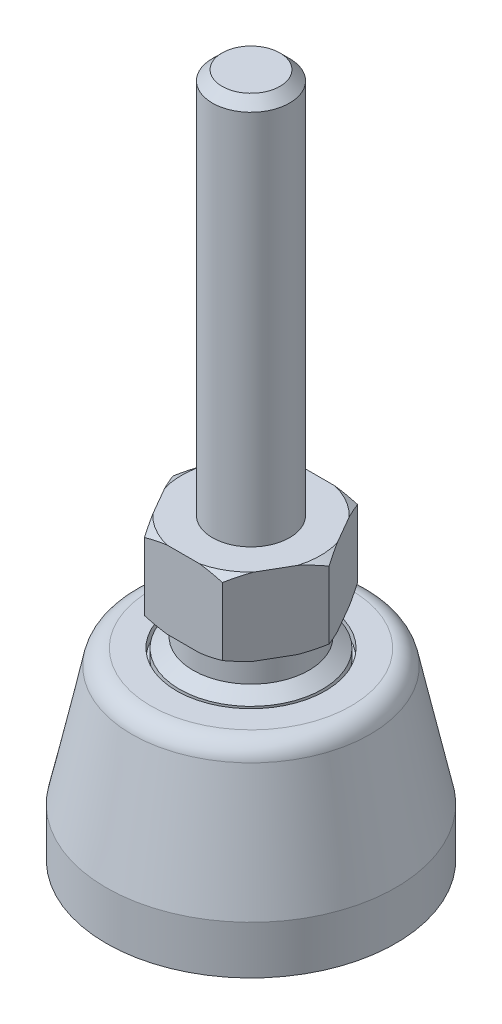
ISO-10303-21;
HEADER;
FILE_DESCRIPTION(('STEP AP214'),'2;1');
FILE_NAME('part.step','',(''),(''),'','','');
FILE_SCHEMA(('AUTOMOTIVE_DESIGN { 1 0 10303 214 1 1 1 1 }'));
ENDSEC;
DATA;
#1=APPLICATION_CONTEXT('core data for automotive mechanical design processes');
#2=APPLICATION_PROTOCOL_DEFINITION('international standard','automotive_design',2000,#1);
#3=PRODUCT_CONTEXT('',#1,'mechanical');
#4=PRODUCT('Part','Part','',(#3));
#5=PRODUCT_RELATED_PRODUCT_CATEGORY('part','',(#4));
#6=PRODUCT_DEFINITION_FORMATION('','',#4);
#7=PRODUCT_DEFINITION_CONTEXT('part definition',#1,'design');
#8=PRODUCT_DEFINITION('design','',#6,#7);
#9=PRODUCT_DEFINITION_SHAPE('','',#8);
#10=(LENGTH_UNIT() NAMED_UNIT(*) SI_UNIT(.MILLI.,.METRE.));
#11=(NAMED_UNIT(*) PLANE_ANGLE_UNIT() SI_UNIT($,.RADIAN.));
#12=(NAMED_UNIT(*) SI_UNIT($,.STERADIAN.) SOLID_ANGLE_UNIT());
#13=UNCERTAINTY_MEASURE_WITH_UNIT(LENGTH_MEASURE(1.E-05),#10,'distance_accuracy_value','');
#14=(GEOMETRIC_REPRESENTATION_CONTEXT(3) GLOBAL_UNCERTAINTY_ASSIGNED_CONTEXT((#13)) GLOBAL_UNIT_ASSIGNED_CONTEXT((#10,
#11,#12)) REPRESENTATION_CONTEXT('',''));
#15=CARTESIAN_POINT('',(0.,0.,0.));
#16=DIRECTION('',(0.,0.,1.));
#17=DIRECTION('',(1.,0.,0.));
#18=AXIS2_PLACEMENT_3D('',#15,#16,#17);
#19=CARTESIAN_POINT('',(0.,0.,0.));
#20=DIRECTION('',(0.,1.,0.));
#21=DIRECTION('',(0.,0.,1.));
#22=AXIS2_PLACEMENT_3D('',#19,#20,#21);
#23=PLANE('',#22);
#24=CARTESIAN_POINT('',(0.,0.,0.));
#25=DIRECTION('',(0.,-1.,0.));
#26=DIRECTION('',(0.,0.,-1.));
#27=AXIS2_PLACEMENT_3D('',#24,#25,#26);
#28=CIRCLE('',#27,7.5);
#29=CARTESIAN_POINT('',(4.03846153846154,0.,-6.31987566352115));
#30=VERTEX_POINT('',#29);
#31=CARTESIAN_POINT('',(4.03846153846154,0.,6.31987566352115));
#32=VERTEX_POINT('',#31);
#33=EDGE_CURVE('E414',#30,#32,#28,.T.);
#34=ORIENTED_EDGE('',*,*,#33,.F.);
#35=CARTESIAN_POINT('',(3.5,0.,-5.47722557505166));
#36=DIRECTION('',(0.,1.,0.));
#37=DIRECTION('',(0.,0.,1.));
#38=AXIS2_PLACEMENT_3D('',#35,#36,#37);
#39=CIRCLE('',#38,1.);
#40=CARTESIAN_POINT('',(2.5,0.,-5.47722557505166));
#41=VERTEX_POINT('',#40);
#42=EDGE_CURVE('E378',#30,#41,#39,.T.);
#43=ORIENTED_EDGE('',*,*,#42,.T.);
#44=DIRECTION('',(0.,0.,-1.));
#45=VECTOR('',#44,1.);
#46=CARTESIAN_POINT('',(2.5,0.,-7.07106781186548));
#47=LINE('',#46,#45);
#48=CARTESIAN_POINT('',(2.5,0.,5.47722557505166));
#49=VERTEX_POINT('',#48);
#50=EDGE_CURVE('E409',#49,#41,#47,.T.);
#51=ORIENTED_EDGE('',*,*,#50,.F.);
#52=CARTESIAN_POINT('',(3.5,0.,5.47722557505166));
#53=DIRECTION('',(0.,1.,0.));
#54=DIRECTION('',(0.,0.,1.));
#55=AXIS2_PLACEMENT_3D('',#52,#53,#54);
#56=CIRCLE('',#55,1.);
#57=EDGE_CURVE('E374',#49,#32,#56,.T.);
#58=ORIENTED_EDGE('',*,*,#57,.T.);
#59=EDGE_LOOP('',(#34,#43,#51,#58));
#60=FACE_BOUND('',#59,.T.);
#61=CARTESIAN_POINT('',(0.,0.,0.));
#62=DIRECTION('',(0.,1.,0.));
#63=DIRECTION('',(0.,0.,1.));
#64=AXIS2_PLACEMENT_3D('',#61,#62,#63);
#65=CIRCLE('',#64,9.5);
#66=CARTESIAN_POINT('',(0.,0.,9.5));
#67=VERTEX_POINT('',#66);
#68=EDGE_CURVE('E648',#67,#67,#65,.F.);
#69=ORIENTED_EDGE('',*,*,#68,.T.);
#70=EDGE_LOOP('',(#69));
#71=FACE_BOUND('',#70,.T.);
#72=CARTESIAN_POINT('',(0.,0.,0.));
#73=DIRECTION('',(0.,-1.,0.));
#74=DIRECTION('',(0.,0.,-1.));
#75=AXIS2_PLACEMENT_3D('',#72,#73,#74);
#76=CIRCLE('',#75,7.5);
#77=CARTESIAN_POINT('',(-4.03846153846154,0.,6.31987566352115));
#78=VERTEX_POINT('',#77);
#79=CARTESIAN_POINT('',(-4.03846153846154,0.,-6.31987566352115));
#80=VERTEX_POINT('',#79);
#81=EDGE_CURVE('E388',#78,#80,#76,.T.);
#82=ORIENTED_EDGE('',*,*,#81,.F.);
#83=CARTESIAN_POINT('',(-3.5,0.,5.47722557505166));
#84=DIRECTION('',(0.,1.,0.));
#85=DIRECTION('',(0.,0.,1.));
#86=AXIS2_PLACEMENT_3D('',#83,#84,#85);
#87=CIRCLE('',#86,1.);
#88=CARTESIAN_POINT('',(-2.5,0.,5.47722557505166));
#89=VERTEX_POINT('',#88);
#90=EDGE_CURVE('E12',#78,#89,#87,.T.);
#91=ORIENTED_EDGE('',*,*,#90,.T.);
#92=DIRECTION('',(0.,0.,1.));
#93=VECTOR('',#92,1.);
#94=CARTESIAN_POINT('',(-2.5,0.,-7.07106781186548));
#95=LINE('',#94,#93);
#96=CARTESIAN_POINT('',(-2.5,0.,-5.47722557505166));
#97=VERTEX_POINT('',#96);
#98=EDGE_CURVE('E390',#97,#89,#95,.T.);
#99=ORIENTED_EDGE('',*,*,#98,.F.);
#100=CARTESIAN_POINT('',(-3.5,0.,-5.47722557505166));
#101=DIRECTION('',(0.,1.,0.));
#102=DIRECTION('',(0.,0.,1.));
#103=AXIS2_PLACEMENT_3D('',#100,#101,#102);
#104=CIRCLE('',#103,1.);
#105=EDGE_CURVE('E66',#97,#80,#104,.T.);
#106=ORIENTED_EDGE('',*,*,#105,.T.);
#107=EDGE_LOOP('',(#82,#91,#99,#106));
#108=FACE_BOUND('',#107,.T.);
#109=ADVANCED_FACE('F57',(#60,#71,#108),#23,.F.);
#110=CARTESIAN_POINT('',(0.,24.9,0.));
#111=DIRECTION('',(0.,1.,0.));
#112=DIRECTION('',(0.,0.,1.));
#113=AXIS2_PLACEMENT_3D('',#110,#111,#112);
#114=PLANE('',#113);
#115=CARTESIAN_POINT('',(0.,24.9,0.));
#116=DIRECTION('',(0.,1.,0.));
#117=DIRECTION('',(0.,0.,1.));
#118=AXIS2_PLACEMENT_3D('',#115,#116,#117);
#119=CIRCLE('',#118,6.);
#120=CARTESIAN_POINT('',(0.,24.9,6.));
#121=VERTEX_POINT('',#120);
#122=EDGE_CURVE('E263',#121,#121,#119,.T.);
#123=ORIENTED_EDGE('',*,*,#122,.T.);
#124=EDGE_LOOP('',(#123));
#125=FACE_BOUND('',#124,.T.);
#126=DIRECTION('',(1.,0.,0.));
#127=VECTOR('',#126,1.);
#128=CARTESIAN_POINT('',(-4.04145188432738,24.9,7.));
#129=LINE('',#128,#127);
#130=CARTESIAN_POINT('',(-1.68522995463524,24.9,7.));
#131=VERTEX_POINT('',#130);
#132=CARTESIAN_POINT('',(1.68522995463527,24.9,7.));
#133=VERTEX_POINT('',#132);
#134=EDGE_CURVE('E537',#131,#133,#129,.T.);
#135=ORIENTED_EDGE('',*,*,#134,.F.);
#136=CARTESIAN_POINT('',(0.,24.9,0.));
#137=DIRECTION('',(0.,1.,0.));
#138=DIRECTION('',(0.,0.,1.));
#139=AXIS2_PLACEMENT_3D('',#136,#137,#138);
#140=CIRCLE('',#139,7.2);
#141=CARTESIAN_POINT('',(-5.21956284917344,24.9,4.95945195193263));
#142=VERTEX_POINT('',#141);
#143=EDGE_CURVE('E413',#142,#131,#140,.T.);
#144=ORIENTED_EDGE('',*,*,#143,.F.);
#145=DIRECTION('',(0.5,0.,0.866025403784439));
#146=VECTOR('',#145,1.);
#147=CARTESIAN_POINT('',(-8.08290376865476,24.9,0.));
#148=LINE('',#147,#146);
#149=CARTESIAN_POINT('',(-6.90479280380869,24.9,2.04054804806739));
#150=VERTEX_POINT('',#149);
#151=EDGE_CURVE('E571',#150,#142,#148,.T.);
#152=ORIENTED_EDGE('',*,*,#151,.F.);
#153=CARTESIAN_POINT('',(-6.9047928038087,24.9,-2.04054804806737));
#154=VERTEX_POINT('',#153);
#155=EDGE_CURVE('E610',#154,#150,#140,.T.);
#156=ORIENTED_EDGE('',*,*,#155,.F.);
#157=DIRECTION('',(-0.5,0.,0.866025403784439));
#158=VECTOR('',#157,1.);
#159=CARTESIAN_POINT('',(-4.04145188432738,24.9,-7.));
#160=LINE('',#159,#158);
#161=CARTESIAN_POINT('',(-5.21956284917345,24.9,-4.95945195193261));
#162=VERTEX_POINT('',#161);
#163=EDGE_CURVE('E567',#162,#154,#160,.T.);
#164=ORIENTED_EDGE('',*,*,#163,.F.);
#165=CARTESIAN_POINT('',(-1.68522995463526,24.9,-7.));
#166=VERTEX_POINT('',#165);
#167=EDGE_CURVE('E603',#166,#162,#140,.T.);
#168=ORIENTED_EDGE('',*,*,#167,.F.);
#169=DIRECTION('',(-1.,0.,0.));
#170=VECTOR('',#169,1.);
#171=CARTESIAN_POINT('',(4.04145188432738,24.9,-7.));
#172=LINE('',#171,#170);
#173=CARTESIAN_POINT('',(1.68522995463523,24.9,-7.));
#174=VERTEX_POINT('',#173);
#175=EDGE_CURVE('E563',#174,#166,#172,.T.);
#176=ORIENTED_EDGE('',*,*,#175,.F.);
#177=CARTESIAN_POINT('',(5.21956284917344,24.9,-4.95945195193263));
#178=VERTEX_POINT('',#177);
#179=EDGE_CURVE('E609',#178,#174,#140,.T.);
#180=ORIENTED_EDGE('',*,*,#179,.F.);
#181=DIRECTION('',(-0.5,0.,-0.866025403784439));
#182=VECTOR('',#181,1.);
#183=CARTESIAN_POINT('',(8.08290376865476,24.9,0.));
#184=LINE('',#183,#182);
#185=CARTESIAN_POINT('',(6.90479280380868,24.9,-2.0405480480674));
#186=VERTEX_POINT('',#185);
#187=EDGE_CURVE('E560',#186,#178,#184,.T.);
#188=ORIENTED_EDGE('',*,*,#187,.F.);
#189=CARTESIAN_POINT('',(6.9047928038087,24.9,2.04054804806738));
#190=VERTEX_POINT('',#189);
#191=EDGE_CURVE('E236',#190,#186,#140,.T.);
#192=ORIENTED_EDGE('',*,*,#191,.F.);
#193=DIRECTION('',(0.5,0.,-0.866025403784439));
#194=VECTOR('',#193,1.);
#195=CARTESIAN_POINT('',(4.04145188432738,24.9,7.));
#196=LINE('',#195,#194);
#197=CARTESIAN_POINT('',(5.21956284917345,24.9,4.95945195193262));
#198=VERTEX_POINT('',#197);
#199=EDGE_CURVE('E252',#198,#190,#196,.T.);
#200=ORIENTED_EDGE('',*,*,#199,.F.);
#201=EDGE_CURVE('E427',#133,#198,#140,.T.);
#202=ORIENTED_EDGE('',*,*,#201,.F.);
#203=EDGE_LOOP('',(#135,#144,#152,#156,#164,#168,#176,#180,#188,#192,#200,#202));
#204=FACE_BOUND('',#203,.T.);
#205=ADVANCED_FACE('F338',(#125,#204),#114,.F.);
#206=CARTESIAN_POINT('',(0.,32.9,0.));
#207=DIRECTION('',(0.,1.,0.));
#208=DIRECTION('',(0.,0.,1.));
#209=AXIS2_PLACEMENT_3D('',#206,#207,#208);
#210=PLANE('',#209);
#211=CARTESIAN_POINT('',(0.,32.9,0.));
#212=DIRECTION('',(0.,1.,0.));
#213=DIRECTION('',(0.,0.,1.));
#214=AXIS2_PLACEMENT_3D('',#211,#212,#213);
#215=CIRCLE('',#214,4.);
#216=CARTESIAN_POINT('',(0.,32.9,4.));
#217=VERTEX_POINT('',#216);
#218=EDGE_CURVE('E527',#217,#217,#215,.T.);
#219=ORIENTED_EDGE('',*,*,#218,.F.);
#220=EDGE_LOOP('',(#219));
#221=FACE_BOUND('',#220,.T.);
#222=CARTESIAN_POINT('',(0.,32.9,0.));
#223=DIRECTION('',(0.,1.,0.));
#224=DIRECTION('',(0.,0.,1.));
#225=AXIS2_PLACEMENT_3D('',#222,#223,#224);
#226=CIRCLE('',#225,7.2);
#227=CARTESIAN_POINT('',(-5.21956284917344,32.9,4.95945195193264));
#228=VERTEX_POINT('',#227);
#229=CARTESIAN_POINT('',(-1.68522995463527,32.9,7.));
#230=VERTEX_POINT('',#229);
#231=EDGE_CURVE('E426',#228,#230,#226,.T.);
#232=ORIENTED_EDGE('',*,*,#231,.T.);
#233=DIRECTION('',(1.,0.,0.));
#234=VECTOR('',#233,1.);
#235=CARTESIAN_POINT('',(-4.04145188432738,32.9,7.));
#236=LINE('',#235,#234);
#237=CARTESIAN_POINT('',(1.68522995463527,32.9,7.));
#238=VERTEX_POINT('',#237);
#239=EDGE_CURVE('E553',#230,#238,#236,.T.);
#240=ORIENTED_EDGE('',*,*,#239,.T.);
#241=CARTESIAN_POINT('',(5.21956284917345,32.9,4.95945195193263));
#242=VERTEX_POINT('',#241);
#243=EDGE_CURVE('E421',#238,#242,#226,.T.);
#244=ORIENTED_EDGE('',*,*,#243,.T.);
#245=DIRECTION('',(0.5,0.,-0.866025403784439));
#246=VECTOR('',#245,1.);
#247=CARTESIAN_POINT('',(4.04145188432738,32.9,7.));
#248=LINE('',#247,#246);
#249=CARTESIAN_POINT('',(6.9047928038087,32.9,2.04054804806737));
#250=VERTEX_POINT('',#249);
#251=EDGE_CURVE('E532',#242,#250,#248,.T.);
#252=ORIENTED_EDGE('',*,*,#251,.T.);
#253=CARTESIAN_POINT('',(6.9047928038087,32.9,-2.04054804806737));
#254=VERTEX_POINT('',#253);
#255=EDGE_CURVE('E425',#250,#254,#226,.T.);
#256=ORIENTED_EDGE('',*,*,#255,.T.);
#257=DIRECTION('',(-0.5,0.,-0.866025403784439));
#258=VECTOR('',#257,1.);
#259=CARTESIAN_POINT('',(8.08290376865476,32.9,0.));
#260=LINE('',#259,#258);
#261=CARTESIAN_POINT('',(5.21956284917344,32.9,-4.95945195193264));
#262=VERTEX_POINT('',#261);
#263=EDGE_CURVE('E536',#254,#262,#260,.T.);
#264=ORIENTED_EDGE('',*,*,#263,.T.);
#265=CARTESIAN_POINT('',(1.68522995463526,32.9,-7.));
#266=VERTEX_POINT('',#265);
#267=EDGE_CURVE('E1140',#262,#266,#226,.T.);
#268=ORIENTED_EDGE('',*,*,#267,.T.);
#269=DIRECTION('',(-1.,0.,0.));
#270=VECTOR('',#269,1.);
#271=CARTESIAN_POINT('',(4.04145188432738,32.9,-7.));
#272=LINE('',#271,#270);
#273=CARTESIAN_POINT('',(-1.68522995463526,32.9,-7.));
#274=VERTEX_POINT('',#273);
#275=EDGE_CURVE('E541',#266,#274,#272,.T.);
#276=ORIENTED_EDGE('',*,*,#275,.T.);
#277=CARTESIAN_POINT('',(-5.21956284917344,32.9,-4.95945195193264));
#278=VERTEX_POINT('',#277);
#279=EDGE_CURVE('E1137',#274,#278,#226,.T.);
#280=ORIENTED_EDGE('',*,*,#279,.T.);
#281=DIRECTION('',(-0.5,0.,0.866025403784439));
#282=VECTOR('',#281,1.);
#283=CARTESIAN_POINT('',(-4.04145188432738,32.9,-7.));
#284=LINE('',#283,#282);
#285=CARTESIAN_POINT('',(-6.9047928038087,32.9,-2.04054804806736));
#286=VERTEX_POINT('',#285);
#287=EDGE_CURVE('E545',#278,#286,#284,.T.);
#288=ORIENTED_EDGE('',*,*,#287,.T.);
#289=CARTESIAN_POINT('',(-6.9047928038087,32.9,2.04054804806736));
#290=VERTEX_POINT('',#289);
#291=EDGE_CURVE('E1135',#286,#290,#226,.T.);
#292=ORIENTED_EDGE('',*,*,#291,.T.);
#293=DIRECTION('',(0.5,0.,0.866025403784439));
#294=VECTOR('',#293,1.);
#295=CARTESIAN_POINT('',(-8.08290376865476,32.9,0.));
#296=LINE('',#295,#294);
#297=EDGE_CURVE('E549',#290,#228,#296,.T.);
#298=ORIENTED_EDGE('',*,*,#297,.T.);
#299=EDGE_LOOP('',(#232,#240,#244,#252,#256,#264,#268,#276,#280,#288,#292,#298));
#300=FACE_BOUND('',#299,.T.);
#301=ADVANCED_FACE('F327',(#221,#300),#210,.T.);
#302=CARTESIAN_POINT('',(0.,21.,0.));
#303=DIRECTION('',(0.,1.,0.));
#304=DIRECTION('',(0.,0.,1.));
#305=AXIS2_PLACEMENT_3D('',#302,#303,#304);
#306=PLANE('',#305);
#307=CARTESIAN_POINT('',(0.,21.,0.));
#308=DIRECTION('',(0.,1.,0.));
#309=DIRECTION('',(0.,0.,1.));
#310=AXIS2_PLACEMENT_3D('',#307,#308,#309);
#311=CIRCLE('',#310,7.7);
#312=CARTESIAN_POINT('',(0.,21.,7.7));
#313=VERTEX_POINT('',#312);
#314=EDGE_CURVE('E280',#313,#313,#311,.T.);
#315=ORIENTED_EDGE('',*,*,#314,.F.);
#316=EDGE_LOOP('',(#315));
#317=FACE_BOUND('',#316,.T.);
#318=CARTESIAN_POINT('',(0.,21.,0.));
#319=DIRECTION('',(0.,1.,0.));
#320=DIRECTION('',(0.,0.,1.));
#321=AXIS2_PLACEMENT_3D('',#318,#319,#320);
#322=CIRCLE('',#321,10.383168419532);
#323=CARTESIAN_POINT('',(0.,21.,10.383168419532));
#324=VERTEX_POINT('',#323);
#325=EDGE_CURVE('E643',#324,#324,#322,.T.);
#326=ORIENTED_EDGE('',*,*,#325,.T.);
#327=EDGE_LOOP('',(#326));
#328=FACE_BOUND('',#327,.T.);
#329=ADVANCED_FACE('F323',(#317,#328),#306,.T.);
#330=CARTESIAN_POINT('',(0.,7.,0.));
#331=DIRECTION('',(0.,-1.,0.));
#332=DIRECTION('',(0.,0.,-1.));
#333=AXIS2_PLACEMENT_3D('',#330,#331,#332);
#334=CYLINDRICAL_SURFACE('',#333,15.);
#335=CARTESIAN_POINT('',(0.,7.,0.));
#336=DIRECTION('',(0.,-1.,0.));
#337=DIRECTION('',(0.,0.,-1.));
#338=AXIS2_PLACEMENT_3D('',#335,#336,#337);
#339=CIRCLE('',#338,15.);
#340=CARTESIAN_POINT('',(0.,7.,-15.));
#341=VERTEX_POINT('',#340);
#342=EDGE_CURVE('E1217',#341,#341,#339,.F.);
#343=ORIENTED_EDGE('',*,*,#342,.F.);
#344=EDGE_LOOP('',(#343));
#345=FACE_BOUND('',#344,.T.);
#346=CARTESIAN_POINT('',(0.,2.,0.));
#347=DIRECTION('',(0.,1.,0.));
#348=DIRECTION('',(0.,0.,1.));
#349=AXIS2_PLACEMENT_3D('',#346,#347,#348);
#350=CIRCLE('',#349,15.);
#351=CARTESIAN_POINT('',(0.,2.,15.));
#352=VERTEX_POINT('',#351);
#353=EDGE_CURVE('E1222',#352,#352,#350,.T.);
#354=ORIENTED_EDGE('',*,*,#353,.T.);
#355=EDGE_LOOP('',(#354));
#356=FACE_BOUND('',#355,.T.);
#357=ADVANCED_FACE('F326',(#345,#356),#334,.T.);
#358=CARTESIAN_POINT('',(0.,2.,0.));
#359=DIRECTION('',(0.,1.,0.));
#360=DIRECTION('',(0.,0.,1.));
#361=AXIS2_PLACEMENT_3D('',#358,#359,#360);
#362=PLANE('',#361);
#363=CARTESIAN_POINT('',(0.,2.,0.));
#364=DIRECTION('',(0.,1.,0.));
#365=DIRECTION('',(0.,0.,1.));
#366=AXIS2_PLACEMENT_3D('',#363,#364,#365);
#367=CIRCLE('',#366,11.5);
#368=CARTESIAN_POINT('',(0.,2.,11.5));
#369=VERTEX_POINT('',#368);
#370=EDGE_CURVE('E1213',#369,#369,#367,.T.);
#371=ORIENTED_EDGE('',*,*,#370,.T.);
#372=EDGE_LOOP('',(#371));
#373=FACE_BOUND('',#372,.T.);
#374=ORIENTED_EDGE('',*,*,#353,.F.);
#375=EDGE_LOOP('',(#374));
#376=FACE_BOUND('',#375,.T.);
#377=ADVANCED_FACE('F329',(#373,#376),#362,.F.);
#378=CARTESIAN_POINT('',(0.,2.,0.));
#379=DIRECTION('',(0.,1.,0.));
#380=DIRECTION('',(0.,0.,1.));
#381=AXIS2_PLACEMENT_3D('',#378,#379,#380);
#382=TOROIDAL_SURFACE('',#381,9.5,2.);
#383=ORIENTED_EDGE('',*,*,#68,.F.);
#384=EDGE_LOOP('',(#383));
#385=FACE_BOUND('',#384,.T.);
#386=ORIENTED_EDGE('',*,*,#370,.F.);
#387=EDGE_LOOP('',(#386));
#388=FACE_BOUND('',#387,.T.);
#389=ADVANCED_FACE('F321',(#385,#388),#382,.T.);
#390=CARTESIAN_POINT('',(0.,21.,0.));
#391=DIRECTION('',(0.,-1.,0.));
#392=DIRECTION('',(0.,0.,-1.));
#393=AXIS2_PLACEMENT_3D('',#390,#391,#392);
#394=CONICAL_SURFACE('',#393,12.,0.211093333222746);
#395=CARTESIAN_POINT('',(0.,19.4190581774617,0.));
#396=DIRECTION('',(0.,1.,0.));
#397=DIRECTION('',(0.,0.,1.));
#398=AXIS2_PLACEMENT_3D('',#395,#396,#397);
#399=CIRCLE('',#398,12.3387732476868);
#400=CARTESIAN_POINT('',(0.,19.4190581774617,12.3387732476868));
#401=VERTEX_POINT('',#400);
#402=EDGE_CURVE('E640',#401,#401,#399,.F.);
#403=ORIENTED_EDGE('',*,*,#402,.T.);
#404=EDGE_LOOP('',(#403));
#405=FACE_BOUND('',#404,.T.);
#406=ORIENTED_EDGE('',*,*,#342,.T.);
#407=EDGE_LOOP('',(#406));
#408=FACE_BOUND('',#407,.T.);
#409=ADVANCED_FACE('F317',(#405,#408),#394,.T.);
#410=CARTESIAN_POINT('',(0.,19.,0.));
#411=DIRECTION('',(0.,1.,0.));
#412=DIRECTION('',(0.,0.,1.));
#413=AXIS2_PLACEMENT_3D('',#410,#411,#412);
#414=TOROIDAL_SURFACE('',#413,10.383168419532,2.);
#415=ORIENTED_EDGE('',*,*,#402,.F.);
#416=EDGE_LOOP('',(#415));
#417=FACE_BOUND('',#416,.T.);
#418=ORIENTED_EDGE('',*,*,#325,.F.);
#419=EDGE_LOOP('',(#418));
#420=FACE_BOUND('',#419,.T.);
#421=ADVANCED_FACE('F320',(#417,#420),#414,.T.);
#422=CARTESIAN_POINT('',(0.,20.,0.));
#423=DIRECTION('',(0.,1.,0.));
#424=DIRECTION('',(0.,0.,1.));
#425=AXIS2_PLACEMENT_3D('',#422,#423,#424);
#426=CYLINDRICAL_SURFACE('',#425,7.7);
#427=CARTESIAN_POINT('',(0.,20.,0.));
#428=DIRECTION('',(0.,1.,0.));
#429=DIRECTION('',(0.,0.,1.));
#430=AXIS2_PLACEMENT_3D('',#427,#428,#429);
#431=CIRCLE('',#430,7.7);
#432=CARTESIAN_POINT('',(0.,20.,7.7));
#433=VERTEX_POINT('',#432);
#434=EDGE_CURVE('E284',#433,#433,#431,.T.);
#435=ORIENTED_EDGE('',*,*,#434,.F.);
#436=EDGE_LOOP('',(#435));
#437=FACE_BOUND('',#436,.T.);
#438=ORIENTED_EDGE('',*,*,#314,.T.);
#439=EDGE_LOOP('',(#438));
#440=FACE_BOUND('',#439,.T.);
#441=ADVANCED_FACE('F315',(#437,#440),#426,.F.);
#442=CARTESIAN_POINT('',(0.,20.,0.));
#443=DIRECTION('',(0.,1.,0.));
#444=DIRECTION('',(0.,0.,1.));
#445=AXIS2_PLACEMENT_3D('',#442,#443,#444);
#446=PLANE('',#445);
#447=CARTESIAN_POINT('',(0.,20.,0.));
#448=DIRECTION('',(0.,1.,0.));
#449=DIRECTION('',(0.,0.,1.));
#450=AXIS2_PLACEMENT_3D('',#447,#448,#449);
#451=CIRCLE('',#450,7.4);
#452=CARTESIAN_POINT('',(0.,20.,7.4));
#453=VERTEX_POINT('',#452);
#454=EDGE_CURVE('E276',#453,#453,#451,.T.);
#455=ORIENTED_EDGE('',*,*,#454,.F.);
#456=EDGE_LOOP('',(#455));
#457=FACE_BOUND('',#456,.T.);
#458=ORIENTED_EDGE('',*,*,#434,.T.);
#459=EDGE_LOOP('',(#458));
#460=FACE_BOUND('',#459,.T.);
#461=ADVANCED_FACE('F669',(#457,#460),#446,.T.);
#462=CARTESIAN_POINT('',(0.,20.,0.));
#463=DIRECTION('',(0.,1.,0.));
#464=DIRECTION('',(0.,0.,1.));
#465=AXIS2_PLACEMENT_3D('',#462,#463,#464);
#466=CYLINDRICAL_SURFACE('',#465,7.4);
#467=ORIENTED_EDGE('',*,*,#454,.T.);
#468=EDGE_LOOP('',(#467));
#469=FACE_BOUND('',#468,.T.);
#470=CARTESIAN_POINT('',(0.,21.,0.));
#471=DIRECTION('',(0.,1.,0.));
#472=DIRECTION('',(0.,0.,1.));
#473=AXIS2_PLACEMENT_3D('',#470,#471,#472);
#474=CIRCLE('',#473,7.4);
#475=CARTESIAN_POINT('',(0.,21.,7.4));
#476=VERTEX_POINT('',#475);
#477=EDGE_CURVE('E269',#476,#476,#474,.T.);
#478=ORIENTED_EDGE('',*,*,#477,.F.);
#479=EDGE_LOOP('',(#478));
#480=FACE_BOUND('',#479,.T.);
#481=ADVANCED_FACE('F313',(#469,#480),#466,.T.);
#482=CARTESIAN_POINT('',(0.,22.,0.));
#483=DIRECTION('',(0.,-1.,0.));
#484=DIRECTION('',(0.,0.,-1.));
#485=AXIS2_PLACEMENT_3D('',#482,#483,#484);
#486=CONICAL_SURFACE('',#485,6.,0.950546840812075);
#487=ORIENTED_EDGE('',*,*,#477,.T.);
#488=EDGE_LOOP('',(#487));
#489=FACE_BOUND('',#488,.T.);
#490=CARTESIAN_POINT('',(0.,22.,0.));
#491=DIRECTION('',(0.,1.,0.));
#492=DIRECTION('',(0.,0.,1.));
#493=AXIS2_PLACEMENT_3D('',#490,#491,#492);
#494=CIRCLE('',#493,6.);
#495=CARTESIAN_POINT('',(0.,22.,6.));
#496=VERTEX_POINT('',#495);
#497=EDGE_CURVE('E288',#496,#496,#494,.T.);
#498=ORIENTED_EDGE('',*,*,#497,.F.);
#499=EDGE_LOOP('',(#498));
#500=FACE_BOUND('',#499,.T.);
#501=ADVANCED_FACE('F302',(#489,#500),#486,.T.);
#502=CARTESIAN_POINT('',(0.,24.9,0.));
#503=DIRECTION('',(0.,-1.,0.));
#504=DIRECTION('',(0.,0.,-1.));
#505=AXIS2_PLACEMENT_3D('',#502,#503,#504);
#506=CYLINDRICAL_SURFACE('',#505,6.);
#507=ORIENTED_EDGE('',*,*,#122,.F.);
#508=EDGE_LOOP('',(#507));
#509=FACE_BOUND('',#508,.T.);
#510=ORIENTED_EDGE('',*,*,#497,.T.);
#511=EDGE_LOOP('',(#510));
#512=FACE_BOUND('',#511,.T.);
#513=ADVANCED_FACE('F312',(#509,#512),#506,.T.);
#514=CARTESIAN_POINT('',(4.04145188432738,32.9,7.));
#515=DIRECTION('',(-0.866025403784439,0.,-0.5));
#516=DIRECTION('',(-0.5,0.,0.866025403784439));
#517=AXIS2_PLACEMENT_3D('',#514,#515,#516);
#518=PLANE('',#517);
#519=DIRECTION('',(0.,-1.,0.));
#520=VECTOR('',#519,1.);
#521=CARTESIAN_POINT('',(8.08290376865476,32.9,0.));
#522=LINE('',#521,#520);
#523=CARTESIAN_POINT('',(8.08290376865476,32.4,0.));
#524=VERTEX_POINT('',#523);
#525=CARTESIAN_POINT('',(8.08290376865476,25.4,0.));
#526=VERTEX_POINT('',#525);
#527=EDGE_CURVE('E249',#524,#526,#522,.T.);
#528=ORIENTED_EDGE('',*,*,#527,.F.);
#529=CARTESIAN_POINT('',(10.8883712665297,30.2250503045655,-4.85921224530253));
#530=CARTESIAN_POINT('',(10.7593149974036,30.343354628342,-4.63568023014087));
#531=CARTESIAN_POINT('',(10.6299546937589,30.4603533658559,-4.41162161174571));
#532=CARTESIAN_POINT('',(10.3704955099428,30.6911160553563,-3.96222512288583));
#533=CARTESIAN_POINT('',(10.240396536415,30.8048795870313,-3.73688709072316));
#534=CARTESIAN_POINT('',(9.97893004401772,31.0288881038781,-3.28401384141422));
#535=CARTESIAN_POINT('',(9.84755974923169,31.139120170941,-3.05647381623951));
#536=CARTESIAN_POINT('',(9.58384515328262,31.3548104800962,-2.59970673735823));
#537=CARTESIAN_POINT('',(9.45150088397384,31.4602688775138,-2.37047973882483));
#538=CARTESIAN_POINT('',(9.1826241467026,31.6677110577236,-1.90477156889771));
#539=CARTESIAN_POINT('',(9.04606536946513,31.7695590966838,-1.66824482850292));
#540=CARTESIAN_POINT('',(8.77158710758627,31.965719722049,-1.19283453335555));
#541=CARTESIAN_POINT('',(8.63366755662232,32.060031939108,-0.953950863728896));
#542=CARTESIAN_POINT('',(8.35644434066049,32.2392409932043,-0.473786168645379));
#543=CARTESIAN_POINT('',(8.21714219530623,32.3241471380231,-0.232507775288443));
#544=CARTESIAN_POINT('',(7.93693537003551,32.48248846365,0.252824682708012));
#545=CARTESIAN_POINT('',(7.79603090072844,32.5559251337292,0.496878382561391));
#546=CARTESIAN_POINT('',(7.45675155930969,32.7150176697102,1.08452743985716));
#547=CARTESIAN_POINT('',(7.25757276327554,32.7941169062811,1.42951523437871));
#548=CARTESIAN_POINT('',(6.95687969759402,32.8872500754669,1.95033090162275));
#549=CARTESIAN_POINT('',(6.85633452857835,32.9140409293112,2.12448024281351));
#550=CARTESIAN_POINT('',(6.65472877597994,32.9584104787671,2.47367164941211));
#551=CARTESIAN_POINT('',(6.5536681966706,32.9759892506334,2.64871370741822));
#552=CARTESIAN_POINT('',(6.35234615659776,33.0012589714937,2.9974137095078));
#553=CARTESIAN_POINT('',(6.25208803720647,33.0090559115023,3.17106586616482));
#554=CARTESIAN_POINT('',(6.05150135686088,33.0148708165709,3.51849218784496));
#555=CARTESIAN_POINT('',(5.95117279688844,33.0128889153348,3.69226635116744));
#556=CARTESIAN_POINT('',(5.75067102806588,32.9992071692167,4.03954560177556));
#557=CARTESIAN_POINT('',(5.65049783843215,32.9875062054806,4.2130506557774));
#558=CARTESIAN_POINT('',(5.45053601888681,32.9547474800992,4.55939468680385));
#559=CARTESIAN_POINT('',(5.35074740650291,32.9336892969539,4.73223363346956));
#560=CARTESIAN_POINT('',(5.10920191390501,32.8719332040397,5.15060269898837));
#561=CARTESIAN_POINT('',(4.96773359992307,32.8266880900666,5.39563300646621));
#562=CARTESIAN_POINT('',(4.68626678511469,32.7206045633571,5.88314783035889));
#563=CARTESIAN_POINT('',(4.54626858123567,32.6597630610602,6.12563183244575));
#564=CARTESIAN_POINT('',(4.26772270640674,32.5248944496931,6.60808743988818));
#565=CARTESIAN_POINT('',(4.12917680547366,32.4508528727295,6.84805597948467));
#566=CARTESIAN_POINT('',(3.85366553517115,32.2919581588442,7.32525549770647));
#567=CARTESIAN_POINT('',(3.71670009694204,32.2071054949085,7.56248659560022));
#568=CARTESIAN_POINT('',(3.44278828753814,32.0276590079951,8.03691576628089));
#569=CARTESIAN_POINT('',(3.3058572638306,31.9329721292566,8.27408725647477));
#570=CARTESIAN_POINT('',(3.03331395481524,31.7363210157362,8.74614611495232));
#571=CARTESIAN_POINT('',(2.89770168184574,31.6343567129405,8.98103346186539));
#572=CARTESIAN_POINT('',(2.62770813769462,31.4245884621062,9.44867599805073));
#573=CARTESIAN_POINT('',(2.49332618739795,31.3167879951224,9.68143236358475));
#574=CARTESIAN_POINT('',(2.22555657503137,31.0963855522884,10.1452229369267));
#575=CARTESIAN_POINT('',(2.09216889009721,30.9837836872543,10.3762571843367));
#576=CARTESIAN_POINT('',(1.89840284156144,30.8168140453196,10.7118698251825));
#577=CARTESIAN_POINT('',(1.83768684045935,30.7640053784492,10.8170330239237));
#578=CARTESIAN_POINT('',(1.71642135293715,30.6576306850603,11.0270710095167));
#579=CARTESIAN_POINT('',(1.65587186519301,30.6040646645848,11.1319457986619));
#580=CARTESIAN_POINT('',(1.53535146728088,30.4966164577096,11.3406932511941));
#581=CARTESIAN_POINT('',(1.47537947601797,30.4427391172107,11.4445677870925));
#582=CARTESIAN_POINT('',(1.35557772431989,30.3343539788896,11.6520705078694));
#583=CARTESIAN_POINT('',(1.29574796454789,30.2798461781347,11.7556986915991));
#584=CARTESIAN_POINT('',(1.23598438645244,30.2250503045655,11.8592122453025));
#585=B_SPLINE_CURVE_WITH_KNOTS('',3,(#529,#530,#531,#532,#533,#534,#535,#536,#537,#538,#539,
#540,#541,#542,#543,#544,#545,#546,#547,#548,#549,#550,#551,#552,#553,#554,#555,#556,#557,#558,
#559,#560,#561,#562,#563,#564,#565,#566,#567,#568,#569,#570,#571,#572,#573,#574,#575,#576,#577,
#578,#579,#580,#581,#582,#583,#584),.UNSPECIFIED.,.F.,.F.,(4,2,2,2,2,2,2,2,2,2,2,2,2,2,2,2,2,2,
2,2,2,2,2,2,2,2,2,4),(0.,0.851808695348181,1.70372755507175,2.55847131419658,3.41318724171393,
4.287565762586,5.16198711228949,6.03553529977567,6.90896996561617,8.12598201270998,
8.73440814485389,9.34282924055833,9.94459919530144,10.5463609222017,11.1481919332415,
11.7500500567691,12.609105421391,13.4683310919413,14.3285043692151,15.1886400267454,
16.0578210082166,16.9270101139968,17.7956863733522,18.6643425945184,19.0615943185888,
19.4588428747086,19.8533077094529,20.2477743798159),.UNSPECIFIED.);
#586=EDGE_CURVE('E531',#524,#250,#585,.T.);
#587=ORIENTED_EDGE('',*,*,#586,.T.);
#588=ORIENTED_EDGE('',*,*,#251,.F.);
#589=CARTESIAN_POINT('',(4.04145188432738,32.4,7.));
#590=VERTEX_POINT('',#589);
#591=EDGE_CURVE('E635',#242,#590,#585,.T.);
#592=ORIENTED_EDGE('',*,*,#591,.T.);
#593=DIRECTION('',(0.,-1.,0.));
#594=VECTOR('',#593,1.);
#595=CARTESIAN_POINT('',(4.04145188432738,32.9,7.));
#596=LINE('',#595,#594);
#597=CARTESIAN_POINT('',(4.04145188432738,25.4,7.));
#598=VERTEX_POINT('',#597);
#599=EDGE_CURVE('E557',#590,#598,#596,.T.);
#600=ORIENTED_EDGE('',*,*,#599,.T.);
#601=CARTESIAN_POINT('',(1.23598438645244,27.5749496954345,11.8592122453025));
#602=CARTESIAN_POINT('',(1.36504065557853,27.456645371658,11.6356802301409));
#603=CARTESIAN_POINT('',(1.49440095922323,27.3396466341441,11.4116216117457));
#604=CARTESIAN_POINT('',(1.75386014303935,27.1088839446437,10.9622251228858));
#605=CARTESIAN_POINT('',(1.88395911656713,26.9951204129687,10.7368870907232));
#606=CARTESIAN_POINT('',(2.14542560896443,26.7711118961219,10.2840138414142));
#607=CARTESIAN_POINT('',(2.27679590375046,26.660879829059,10.0564738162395));
#608=CARTESIAN_POINT('',(2.54051049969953,26.4451895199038,9.59970673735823));
#609=CARTESIAN_POINT('',(2.67285476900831,26.3397311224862,9.37047973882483));
#610=CARTESIAN_POINT('',(2.94173150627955,26.1322889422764,8.9047715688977));
#611=CARTESIAN_POINT('',(3.07829028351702,26.0304409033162,8.66824482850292));
#612=CARTESIAN_POINT('',(3.35276854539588,25.834280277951,8.19283453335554));
#613=CARTESIAN_POINT('',(3.49068809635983,25.739968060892,7.95395086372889));
#614=CARTESIAN_POINT('',(3.76791131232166,25.5607590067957,7.47378616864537));
#615=CARTESIAN_POINT('',(3.90721345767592,25.4758528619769,7.23250777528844));
#616=CARTESIAN_POINT('',(4.18742028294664,25.31751153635,6.74717531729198));
#617=CARTESIAN_POINT('',(4.32832475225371,25.2440748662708,6.50312161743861));
#618=CARTESIAN_POINT('',(4.66760409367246,25.0849823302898,5.91547256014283));
#619=CARTESIAN_POINT('',(4.86678288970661,25.0058830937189,5.57048476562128));
#620=CARTESIAN_POINT('',(5.16747595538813,24.9127499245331,5.04966909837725));
#621=CARTESIAN_POINT('',(5.26802112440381,24.8859590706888,4.87551975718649));
#622=CARTESIAN_POINT('',(5.46962687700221,24.8415895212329,4.52632835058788));
#623=CARTESIAN_POINT('',(5.57068745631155,24.8240107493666,4.35128629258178));
#624=CARTESIAN_POINT('',(5.77200949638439,24.7987410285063,4.0025862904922));
#625=CARTESIAN_POINT('',(5.87226761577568,24.7909440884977,3.82893413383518));
#626=CARTESIAN_POINT('',(6.07285429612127,24.7851291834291,3.48150781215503));
#627=CARTESIAN_POINT('',(6.17318285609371,24.7871110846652,3.30773364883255));
#628=CARTESIAN_POINT('',(6.37368462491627,24.8007928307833,2.96045439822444));
#629=CARTESIAN_POINT('',(6.47385781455,24.8124937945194,2.78694934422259));
#630=CARTESIAN_POINT('',(6.67381963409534,24.8452525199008,2.44060531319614));
#631=CARTESIAN_POINT('',(6.77360824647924,24.8663107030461,2.26776636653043));
#632=CARTESIAN_POINT('',(7.01515373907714,24.9280667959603,1.84939730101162));
#633=CARTESIAN_POINT('',(7.15662205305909,24.9733119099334,1.60436699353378));
#634=CARTESIAN_POINT('',(7.43808886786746,25.0793954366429,1.1168521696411));
#635=CARTESIAN_POINT('',(7.57808707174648,25.1402369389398,0.874368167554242));
#636=CARTESIAN_POINT('',(7.85663294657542,25.2751055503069,0.391912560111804));
#637=CARTESIAN_POINT('',(7.99517884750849,25.3491471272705,0.151944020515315));
#638=CARTESIAN_POINT('',(8.27069011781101,25.5080418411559,-0.325255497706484));
#639=CARTESIAN_POINT('',(8.40765555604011,25.5928945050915,-0.562486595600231));
#640=CARTESIAN_POINT('',(8.68156736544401,25.7723409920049,-1.03691576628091));
#641=CARTESIAN_POINT('',(8.81849838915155,25.8670278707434,-1.27408725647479));
#642=CARTESIAN_POINT('',(9.09104169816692,26.0636789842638,-1.74614611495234));
#643=CARTESIAN_POINT('',(9.22665397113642,26.1656432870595,-1.98103346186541));
#644=CARTESIAN_POINT('',(9.49664751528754,26.3754115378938,-2.44867599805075));
#645=CARTESIAN_POINT('',(9.63102946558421,26.4832120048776,-2.68143236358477));
#646=CARTESIAN_POINT('',(9.89879907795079,26.7036144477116,-3.14522293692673));
#647=CARTESIAN_POINT('',(10.032186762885,26.8162163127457,-3.37625718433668));
#648=CARTESIAN_POINT('',(10.2259528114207,26.9831859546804,-3.71186982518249));
#649=CARTESIAN_POINT('',(10.2866688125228,27.0359946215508,-3.81703302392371));
#650=CARTESIAN_POINT('',(10.407934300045,27.1423693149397,-4.02707100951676));
#651=CARTESIAN_POINT('',(10.4684837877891,27.1959353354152,-4.13194579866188));
#652=CARTESIAN_POINT('',(10.5890041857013,27.3033835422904,-4.3406932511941));
#653=CARTESIAN_POINT('',(10.6489761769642,27.3572608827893,-4.44456778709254));
#654=CARTESIAN_POINT('',(10.7687779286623,27.4656460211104,-4.65207050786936));
#655=CARTESIAN_POINT('',(10.8286076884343,27.5201538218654,-4.75569869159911));
#656=CARTESIAN_POINT('',(10.8883712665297,27.5749496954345,-4.85921224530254));
#657=B_SPLINE_CURVE_WITH_KNOTS('',3,(#601,#602,#603,#604,#605,#606,#607,#608,#609,#610,#611,
#612,#613,#614,#615,#616,#617,#618,#619,#620,#621,#622,#623,#624,#625,#626,#627,#628,#629,#630,
#631,#632,#633,#634,#635,#636,#637,#638,#639,#640,#641,#642,#643,#644,#645,#646,#647,#648,#649,
#650,#651,#652,#653,#654,#655,#656),.UNSPECIFIED.,.F.,.F.,(4,2,2,2,2,2,2,2,2,2,2,2,2,2,2,2,2,2,
2,2,2,2,2,2,2,2,2,4),(0.,0.851808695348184,1.70372755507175,2.55847131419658,3.41318724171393,
4.28756576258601,5.1619871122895,6.03553529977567,6.90896996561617,8.12598201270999,
8.73440814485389,9.34282924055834,9.94459919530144,10.5463609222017,11.1481919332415,
11.7500500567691,12.6091054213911,13.4683310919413,14.3285043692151,15.1886400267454,
16.0578210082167,16.9270101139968,17.7956863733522,18.6643425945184,19.0615943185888,
19.4588428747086,19.8533077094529,20.2477743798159),.UNSPECIFIED.);
#658=EDGE_CURVE('E256',#598,#198,#657,.T.);
#659=ORIENTED_EDGE('',*,*,#658,.T.);
#660=ORIENTED_EDGE('',*,*,#199,.T.);
#661=EDGE_CURVE('E234',#190,#526,#657,.T.);
#662=ORIENTED_EDGE('',*,*,#661,.T.);
#663=EDGE_LOOP('',(#528,#587,#588,#592,#600,#659,#660,#662));
#664=FACE_BOUND('',#663,.T.);
#665=ADVANCED_FACE('F247',(#664),#518,.F.);
#666=CARTESIAN_POINT('',(8.08290376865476,32.9,0.));
#667=DIRECTION('',(-0.866025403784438,0.,0.5));
#668=DIRECTION('',(0.5,0.,0.866025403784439));
#669=AXIS2_PLACEMENT_3D('',#666,#667,#668);
#670=PLANE('',#669);
#671=DIRECTION('',(0.,-1.,0.));
#672=VECTOR('',#671,1.);
#673=CARTESIAN_POINT('',(4.04145188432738,32.9,-7.));
#674=LINE('',#673,#672);
#675=CARTESIAN_POINT('',(4.04145188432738,32.4,-7.));
#676=VERTEX_POINT('',#675);
#677=CARTESIAN_POINT('',(4.04145188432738,25.4,-7.));
#678=VERTEX_POINT('',#677);
#679=EDGE_CURVE('E264',#676,#678,#674,.T.);
#680=ORIENTED_EDGE('',*,*,#679,.F.);
#681=CARTESIAN_POINT('',(1.23598438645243,30.2250503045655,-11.8592122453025));
#682=CARTESIAN_POINT('',(1.36504065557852,30.343354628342,-11.6356802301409));
#683=CARTESIAN_POINT('',(1.49440095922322,30.4603533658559,-11.4116216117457));
#684=CARTESIAN_POINT('',(1.75386014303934,30.6911160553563,-10.9622251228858));
#685=CARTESIAN_POINT('',(1.88395911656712,30.8048795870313,-10.7368870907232));
#686=CARTESIAN_POINT('',(2.14542560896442,31.0288881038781,-10.2840138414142));
#687=CARTESIAN_POINT('',(2.27679590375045,31.139120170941,-10.0564738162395));
#688=CARTESIAN_POINT('',(2.54051049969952,31.3548104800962,-9.59970673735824));
#689=CARTESIAN_POINT('',(2.67285476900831,31.4602688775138,-9.37047973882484));
#690=CARTESIAN_POINT('',(2.94173150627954,31.6677110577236,-8.90477156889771));
#691=CARTESIAN_POINT('',(3.07829028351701,31.7695590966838,-8.66824482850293));
#692=CARTESIAN_POINT('',(3.35276854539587,31.965719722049,-8.19283453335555));
#693=CARTESIAN_POINT('',(3.49068809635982,32.060031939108,-7.9539508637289));
#694=CARTESIAN_POINT('',(3.76791131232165,32.2392409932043,-7.47378616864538));
#695=CARTESIAN_POINT('',(3.90721345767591,32.3241471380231,-7.23250777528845));
#696=CARTESIAN_POINT('',(4.18742028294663,32.48248846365,-6.74717531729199));
#697=CARTESIAN_POINT('',(4.3283247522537,32.5559251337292,-6.50312161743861));
#698=CARTESIAN_POINT('',(4.66760409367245,32.7150176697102,-5.91547256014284));
#699=CARTESIAN_POINT('',(4.8667828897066,32.7941169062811,-5.57048476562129));
#700=CARTESIAN_POINT('',(5.16747595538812,32.8872500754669,-5.04966909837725));
#701=CARTESIAN_POINT('',(5.2680211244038,32.9140409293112,-4.8755197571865));
#702=CARTESIAN_POINT('',(5.46962687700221,32.9584104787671,-4.52632835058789));
#703=CARTESIAN_POINT('',(5.57068745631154,32.9759892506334,-4.35128629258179));
#704=CARTESIAN_POINT('',(5.77200949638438,33.0012589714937,-4.0025862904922));
#705=CARTESIAN_POINT('',(5.87226761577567,33.0090559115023,-3.82893413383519));
#706=CARTESIAN_POINT('',(6.07285429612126,33.0148708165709,-3.48150781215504));
#707=CARTESIAN_POINT('',(6.1731828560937,33.0128889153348,-3.30773364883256));
#708=CARTESIAN_POINT('',(6.37368462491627,32.9992071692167,-2.96045439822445));
#709=CARTESIAN_POINT('',(6.47385781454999,32.9875062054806,-2.7869493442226));
#710=CARTESIAN_POINT('',(6.67381963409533,32.9547474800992,-2.44060531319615));
#711=CARTESIAN_POINT('',(6.77360824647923,32.9336892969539,-2.26776636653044));
#712=CARTESIAN_POINT('',(7.01515373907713,32.8719332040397,-1.84939730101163));
#713=CARTESIAN_POINT('',(7.15662205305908,32.8266880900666,-1.60436699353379));
#714=CARTESIAN_POINT('',(7.43808886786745,32.7206045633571,-1.11685216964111));
#715=CARTESIAN_POINT('',(7.57808707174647,32.6597630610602,-0.874368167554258));
#716=CARTESIAN_POINT('',(7.85663294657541,32.5248944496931,-0.391912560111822));
#717=CARTESIAN_POINT('',(7.99517884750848,32.4508528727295,-0.151944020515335));
#718=CARTESIAN_POINT('',(8.270690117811,32.2919581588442,0.325255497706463));
#719=CARTESIAN_POINT('',(8.4076555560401,32.2071054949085,0.562486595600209));
#720=CARTESIAN_POINT('',(8.681567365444,32.0276590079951,1.03691576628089));
#721=CARTESIAN_POINT('',(8.81849838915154,31.9329721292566,1.27408725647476));
#722=CARTESIAN_POINT('',(9.0910416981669,31.7363210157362,1.74614611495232));
#723=CARTESIAN_POINT('',(9.2266539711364,31.6343567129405,1.98103346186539));
#724=CARTESIAN_POINT('',(9.49664751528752,31.4245884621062,2.44867599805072));
#725=CARTESIAN_POINT('',(9.63102946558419,31.3167879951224,2.68143236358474));
#726=CARTESIAN_POINT('',(9.89879907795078,31.0963855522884,3.1452229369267));
#727=CARTESIAN_POINT('',(10.0321867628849,30.9837836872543,3.37625718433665));
#728=CARTESIAN_POINT('',(10.2259528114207,30.8168140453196,3.71186982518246));
#729=CARTESIAN_POINT('',(10.2866688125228,30.7640053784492,3.81703302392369));
#730=CARTESIAN_POINT('',(10.407934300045,30.6576306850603,4.02707100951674));
#731=CARTESIAN_POINT('',(10.4684837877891,30.6040646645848,4.13194579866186));
#732=CARTESIAN_POINT('',(10.5890041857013,30.4966164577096,4.34069325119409));
#733=CARTESIAN_POINT('',(10.6489761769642,30.4427391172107,4.44456778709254));
#734=CARTESIAN_POINT('',(10.7687779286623,30.3343539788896,4.65207050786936));
#735=CARTESIAN_POINT('',(10.8286076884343,30.2798461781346,4.75569869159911));
#736=CARTESIAN_POINT('',(10.8883712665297,30.2250503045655,4.85921224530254));
#737=B_SPLINE_CURVE_WITH_KNOTS('',3,(#681,#682,#683,#684,#685,#686,#687,#688,#689,#690,#691,
#692,#693,#694,#695,#696,#697,#698,#699,#700,#701,#702,#703,#704,#705,#706,#707,#708,#709,#710,
#711,#712,#713,#714,#715,#716,#717,#718,#719,#720,#721,#722,#723,#724,#725,#726,#727,#728,#729,
#730,#731,#732,#733,#734,#735,#736),.UNSPECIFIED.,.F.,.F.,(4,2,2,2,2,2,2,2,2,2,2,2,2,2,2,2,2,2,
2,2,2,2,2,2,2,2,2,4),(0.,0.851808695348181,1.70372755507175,2.55847131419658,3.41318724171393,
4.287565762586,5.16198711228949,6.03553529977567,6.90896996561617,8.12598201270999,
8.73440814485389,9.34282924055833,9.94459919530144,10.5463609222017,11.1481919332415,
11.7500500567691,12.6091054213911,13.4683310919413,14.3285043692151,15.1886400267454,
16.0578210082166,16.9270101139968,17.7956863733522,18.6643425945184,19.0615943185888,
19.4588428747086,19.8533077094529,20.2477743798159),.UNSPECIFIED.);
#738=EDGE_CURVE('E519',#676,#262,#737,.T.);
#739=ORIENTED_EDGE('',*,*,#738,.T.);
#740=ORIENTED_EDGE('',*,*,#263,.F.);
#741=EDGE_CURVE('E261',#254,#524,#737,.T.);
#742=ORIENTED_EDGE('',*,*,#741,.T.);
#743=ORIENTED_EDGE('',*,*,#527,.T.);
#744=CARTESIAN_POINT('',(10.8883712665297,27.5749496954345,4.85921224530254));
#745=CARTESIAN_POINT('',(10.7593149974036,27.456645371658,4.63568023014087));
#746=CARTESIAN_POINT('',(10.6299546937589,27.3396466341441,4.41162161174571));
#747=CARTESIAN_POINT('',(10.3704955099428,27.1088839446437,3.96222512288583));
#748=CARTESIAN_POINT('',(10.240396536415,26.9951204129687,3.73688709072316));
#749=CARTESIAN_POINT('',(9.97893004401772,26.7711118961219,3.28401384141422));
#750=CARTESIAN_POINT('',(9.84755974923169,26.660879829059,3.05647381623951));
#751=CARTESIAN_POINT('',(9.58384515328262,26.4451895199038,2.59970673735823));
#752=CARTESIAN_POINT('',(9.45150088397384,26.3397311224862,2.37047973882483));
#753=CARTESIAN_POINT('',(9.1826241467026,26.1322889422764,1.9047715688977));
#754=CARTESIAN_POINT('',(9.04606536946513,26.0304409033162,1.66824482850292));
#755=CARTESIAN_POINT('',(8.77158710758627,25.834280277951,1.19283453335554));
#756=CARTESIAN_POINT('',(8.63366755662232,25.739968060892,0.95395086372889));
#757=CARTESIAN_POINT('',(8.35644434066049,25.5607590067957,0.473786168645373));
#758=CARTESIAN_POINT('',(8.21714219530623,25.4758528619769,0.232507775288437));
#759=CARTESIAN_POINT('',(7.93693537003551,25.31751153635,-0.252824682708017));
#760=CARTESIAN_POINT('',(7.79603090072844,25.2440748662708,-0.496878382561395));
#761=CARTESIAN_POINT('',(7.45675155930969,25.0849823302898,-1.08452743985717));
#762=CARTESIAN_POINT('',(7.25757276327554,25.0058830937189,-1.42951523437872));
#763=CARTESIAN_POINT('',(6.95687969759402,24.9127499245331,-1.95033090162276));
#764=CARTESIAN_POINT('',(6.85633452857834,24.8859590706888,-2.12448024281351));
#765=CARTESIAN_POINT('',(6.65472877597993,24.8415895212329,-2.47367164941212));
#766=CARTESIAN_POINT('',(6.5536681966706,24.8240107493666,-2.64871370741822));
#767=CARTESIAN_POINT('',(6.35234615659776,24.7987410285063,-2.9974137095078));
#768=CARTESIAN_POINT('',(6.25208803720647,24.7909440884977,-3.17106586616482));
#769=CARTESIAN_POINT('',(6.05150135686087,24.7851291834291,-3.51849218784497));
#770=CARTESIAN_POINT('',(5.95117279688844,24.7871110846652,-3.69226635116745));
#771=CARTESIAN_POINT('',(5.75067102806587,24.8007928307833,-4.03954560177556));
#772=CARTESIAN_POINT('',(5.65049783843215,24.8124937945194,-4.21305065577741));
#773=CARTESIAN_POINT('',(5.4505360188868,24.8452525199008,-4.55939468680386));
#774=CARTESIAN_POINT('',(5.35074740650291,24.8663107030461,-4.73223363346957));
#775=CARTESIAN_POINT('',(5.10920191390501,24.9280667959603,-5.15060269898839));
#776=CARTESIAN_POINT('',(4.96773359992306,24.9733119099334,-5.39563300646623));
#777=CARTESIAN_POINT('',(4.68626678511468,25.0793954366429,-5.88314783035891));
#778=CARTESIAN_POINT('',(4.54626858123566,25.1402369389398,-6.12563183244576));
#779=CARTESIAN_POINT('',(4.26772270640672,25.2751055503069,-6.6080874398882));
#780=CARTESIAN_POINT('',(4.12917680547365,25.3491471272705,-6.84805597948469));
#781=CARTESIAN_POINT('',(3.85366553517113,25.5080418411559,-7.32525549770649));
#782=CARTESIAN_POINT('',(3.71670009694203,25.5928945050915,-7.56248659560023));
#783=CARTESIAN_POINT('',(3.44278828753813,25.7723409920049,-8.03691576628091));
#784=CARTESIAN_POINT('',(3.30585726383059,25.8670278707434,-8.27408725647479));
#785=CARTESIAN_POINT('',(3.03331395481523,26.0636789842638,-8.74614611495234));
#786=CARTESIAN_POINT('',(2.89770168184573,26.1656432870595,-8.98103346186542));
#787=CARTESIAN_POINT('',(2.6277081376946,26.3754115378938,-9.44867599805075));
#788=CARTESIAN_POINT('',(2.49332618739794,26.4832120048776,-9.68143236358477));
#789=CARTESIAN_POINT('',(2.22555657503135,26.7036144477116,-10.1452229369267));
#790=CARTESIAN_POINT('',(2.09216889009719,26.8162163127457,-10.3762571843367));
#791=CARTESIAN_POINT('',(1.89840284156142,26.9831859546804,-10.7118698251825));
#792=CARTESIAN_POINT('',(1.83768684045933,27.0359946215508,-10.8170330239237));
#793=CARTESIAN_POINT('',(1.71642135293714,27.1423693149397,-11.0270710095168));
#794=CARTESIAN_POINT('',(1.655871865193,27.1959353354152,-11.1319457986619));
#795=CARTESIAN_POINT('',(1.53535146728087,27.3033835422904,-11.3406932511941));
#796=CARTESIAN_POINT('',(1.47537947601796,27.3572608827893,-11.4445677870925));
#797=CARTESIAN_POINT('',(1.35557772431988,27.4656460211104,-11.6520705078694));
#798=CARTESIAN_POINT('',(1.29574796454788,27.5201538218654,-11.7556986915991));
#799=CARTESIAN_POINT('',(1.23598438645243,27.5749496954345,-11.8592122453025));
#800=B_SPLINE_CURVE_WITH_KNOTS('',3,(#744,#745,#746,#747,#748,#749,#750,#751,#752,#753,#754,
#755,#756,#757,#758,#759,#760,#761,#762,#763,#764,#765,#766,#767,#768,#769,#770,#771,#772,#773,
#774,#775,#776,#777,#778,#779,#780,#781,#782,#783,#784,#785,#786,#787,#788,#789,#790,#791,#792,
#793,#794,#795,#796,#797,#798,#799),.UNSPECIFIED.,.F.,.F.,(4,2,2,2,2,2,2,2,2,2,2,2,2,2,2,2,2,2,
2,2,2,2,2,2,2,2,2,4),(0.,0.851808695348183,1.70372755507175,2.55847131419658,3.41318724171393,
4.28756576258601,5.16198711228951,6.03553529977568,6.90896996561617,8.12598201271,
8.7344081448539,9.34282924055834,9.94459919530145,10.5463609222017,11.1481919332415,
11.7500500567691,12.6091054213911,13.4683310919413,14.3285043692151,15.1886400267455,
16.0578210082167,16.9270101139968,17.7956863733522,18.6643425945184,19.0615943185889,
19.4588428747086,19.8533077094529,20.2477743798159),.UNSPECIFIED.);
#801=EDGE_CURVE('E231',#526,#186,#800,.T.);
#802=ORIENTED_EDGE('',*,*,#801,.T.);
#803=ORIENTED_EDGE('',*,*,#187,.T.);
#804=EDGE_CURVE('E242',#178,#678,#800,.T.);
#805=ORIENTED_EDGE('',*,*,#804,.T.);
#806=EDGE_LOOP('',(#680,#739,#740,#742,#743,#802,#803,#805));
#807=FACE_BOUND('',#806,.T.);
#808=ADVANCED_FACE('F259',(#807),#670,.F.);
#809=CARTESIAN_POINT('',(4.04145188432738,32.9,-7.));
#810=DIRECTION('',(0.,0.,1.));
#811=DIRECTION('',(1.,0.,0.));
#812=AXIS2_PLACEMENT_3D('',#809,#810,#811);
#813=PLANE('',#812);
#814=DIRECTION('',(0.,-1.,0.));
#815=VECTOR('',#814,1.);
#816=CARTESIAN_POINT('',(-4.04145188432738,32.9,-7.));
#817=LINE('',#816,#815);
#818=CARTESIAN_POINT('',(-4.04145188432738,32.4,-7.));
#819=VERTEX_POINT('',#818);
#820=CARTESIAN_POINT('',(-4.04145188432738,25.4,-7.));
#821=VERTEX_POINT('',#820);
#822=EDGE_CURVE('E272',#819,#821,#817,.T.);
#823=ORIENTED_EDGE('',*,*,#822,.F.);
#824=CARTESIAN_POINT('',(-8.90066412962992,30.5648035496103,-7.));
#825=CARTESIAN_POINT('',(-8.64444732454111,30.6788248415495,-7.));
#826=CARTESIAN_POINT('',(-8.38754279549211,30.7913310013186,-7.));
#827=CARTESIAN_POINT('',(-7.87206004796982,31.0125688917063,-7.));
#828=CARTESIAN_POINT('',(-7.61348153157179,31.1212999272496,-7.));
#829=CARTESIAN_POINT('',(-7.09334290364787,31.3346536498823,-7.));
#830=CARTESIAN_POINT('',(-6.8317747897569,31.439256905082,-7.));
#831=CARTESIAN_POINT('',(-6.3064623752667,31.6428341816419,-7.));
#832=CARTESIAN_POINT('',(-6.04271817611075,31.7418084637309,-7.));
#833=CARTESIAN_POINT('',(-5.51419004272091,31.9323392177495,-7.));
#834=CARTESIAN_POINT('',(-5.24941980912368,32.0239334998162,-7.));
#835=CARTESIAN_POINT('',(-4.71710055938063,32.1987640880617,-7.));
#836=CARTESIAN_POINT('',(-4.44955140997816,32.2819999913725,-7.));
#837=CARTESIAN_POINT('',(-3.91183442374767,32.4381359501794,-7.));
#838=CARTESIAN_POINT('',(-3.64167074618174,32.51105021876,-7.));
#839=CARTESIAN_POINT('',(-3.0982771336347,32.6445318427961,-7.));
#840=CARTESIAN_POINT('',(-2.82504732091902,32.7050996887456,-7.));
#841=CARTESIAN_POINT('',(-2.35040353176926,32.7971164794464,-7.));
#842=CARTESIAN_POINT('',(-2.14965637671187,32.8320054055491,-7.));
#843=CARTESIAN_POINT('',(-1.74687433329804,32.8931647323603,-7.));
#844=CARTESIAN_POINT('',(-1.54483966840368,32.9194365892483,-7.));
#845=CARTESIAN_POINT('',(-1.13980745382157,32.9626330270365,-7.));
#846=CARTESIAN_POINT('',(-0.936810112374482,32.9795595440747,-7.));
#847=CARTESIAN_POINT('',(-0.530228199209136,33.0035552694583,-7.));
#848=CARTESIAN_POINT('',(-0.326643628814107,33.0106244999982,-7.));
#849=CARTESIAN_POINT('',(0.0805797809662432,33.0146762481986,-7.));
#850=CARTESIAN_POINT('',(0.284218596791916,33.0116611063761,-7.));
#851=CARTESIAN_POINT('',(0.691098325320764,32.9956480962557,-7.));
#852=CARTESIAN_POINT('',(0.894339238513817,32.9826502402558,-7.));
#853=CARTESIAN_POINT('',(1.3000044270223,32.9470773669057,-7.));
#854=CARTESIAN_POINT('',(1.5024285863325,32.9245010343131,-7.));
#855=CARTESIAN_POINT('',(1.90609583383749,32.8704265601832,-7.));
#856=CARTESIAN_POINT('',(2.10733870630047,32.8389268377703,-7.));
#857=CARTESIAN_POINT('',(2.8779360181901,32.7022783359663,-7.));
#858=CARTESIAN_POINT('',(3.44231033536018,32.5683717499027,-7.));
#859=CARTESIAN_POINT('',(4.27909971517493,32.333280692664,-7.));
#860=CARTESIAN_POINT('',(4.55668975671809,32.2491044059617,-7.));
#861=CARTESIAN_POINT('',(5.10889323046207,32.0714301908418,-7.));
#862=CARTESIAN_POINT('',(5.38350683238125,31.9779327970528,-7.));
#863=CARTESIAN_POINT('',(5.93237928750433,31.7825648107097,-7.));
#864=CARTESIAN_POINT('',(6.20661460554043,31.6806288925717,-7.));
#865=CARTESIAN_POINT('',(6.75270657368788,31.4705453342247,-7.));
#866=CARTESIAN_POINT('',(7.02456309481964,31.3623973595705,-7.));
#867=CARTESIAN_POINT('',(7.56481729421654,31.1416375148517,-7.));
#868=CARTESIAN_POINT('',(7.83322556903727,31.0290514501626,-7.));
#869=CARTESIAN_POINT('',(8.36822333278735,30.7997862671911,-7.));
#870=CARTESIAN_POINT('',(8.63481319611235,30.6831080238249,-7.));
#871=CARTESIAN_POINT('',(8.90066412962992,30.5648035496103,-7.));
#872=B_SPLINE_CURVE_WITH_KNOTS('',3,(#824,#825,#826,#827,#828,#829,#830,#831,#832,#833,#834,
#835,#836,#837,#838,#839,#840,#841,#842,#843,#844,#845,#846,#847,#848,#849,#850,#851,#852,#853,
#854,#855,#856,#857,#858,#859,#860,#861,#862,#863,#864,#865,#866,#867,#868,#869,#870,#871),
.UNSPECIFIED.,.F.,.F.,(4,2,2,2,2,2,2,2,2,2,2,2,2,2,2,2,2,2,2,2,2,2,2,4),(0.,0.841340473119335,
1.68283504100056,2.52790720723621,3.37294019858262,4.21332468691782,5.05374966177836,
5.89300585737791,6.73222870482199,7.34333494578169,7.95433786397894,8.56521414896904,
9.17608905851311,9.78682219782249,10.3975545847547,11.0083708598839,11.6192954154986,
13.3559222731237,14.2260816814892,15.0961912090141,15.9738134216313,16.8514829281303,
17.7246406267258,18.5976127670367),.UNSPECIFIED.);
#873=EDGE_CURVE('E502',#819,#274,#872,.T.);
#874=ORIENTED_EDGE('',*,*,#873,.T.);
#875=ORIENTED_EDGE('',*,*,#275,.F.);
#876=EDGE_CURVE('E511',#266,#676,#872,.T.);
#877=ORIENTED_EDGE('',*,*,#876,.T.);
#878=ORIENTED_EDGE('',*,*,#679,.T.);
#879=CARTESIAN_POINT('',(8.90066412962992,27.2351964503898,-7.));
#880=CARTESIAN_POINT('',(8.64444732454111,27.1211751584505,-7.));
#881=CARTESIAN_POINT('',(8.38754279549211,27.0086689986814,-7.));
#882=CARTESIAN_POINT('',(7.87206004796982,26.7874311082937,-7.));
#883=CARTESIAN_POINT('',(7.61348153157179,26.6787000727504,-7.));
#884=CARTESIAN_POINT('',(7.09334290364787,26.4653463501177,-7.));
#885=CARTESIAN_POINT('',(6.8317747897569,26.360743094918,-7.));
#886=CARTESIAN_POINT('',(6.30646237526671,26.1571658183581,-7.));
#887=CARTESIAN_POINT('',(6.04271817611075,26.0581915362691,-7.));
#888=CARTESIAN_POINT('',(5.51419004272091,25.8676607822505,-7.));
#889=CARTESIAN_POINT('',(5.24941980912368,25.7760665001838,-7.));
#890=CARTESIAN_POINT('',(4.71710055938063,25.6012359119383,-7.));
#891=CARTESIAN_POINT('',(4.44955140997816,25.5180000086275,-7.));
#892=CARTESIAN_POINT('',(3.91183442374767,25.3618640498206,-7.));
#893=CARTESIAN_POINT('',(3.64167074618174,25.28894978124,-7.));
#894=CARTESIAN_POINT('',(3.0982771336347,25.1554681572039,-7.));
#895=CARTESIAN_POINT('',(2.82504732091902,25.0949003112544,-7.));
#896=CARTESIAN_POINT('',(2.35040353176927,25.0028835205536,-7.));
#897=CARTESIAN_POINT('',(2.14965637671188,24.9679945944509,-7.));
#898=CARTESIAN_POINT('',(1.74687433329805,24.9068352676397,-7.));
#899=CARTESIAN_POINT('',(1.54483966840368,24.8805634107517,-7.));
#900=CARTESIAN_POINT('',(1.13980745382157,24.8373669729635,-7.));
#901=CARTESIAN_POINT('',(0.936810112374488,24.8204404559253,-7.));
#902=CARTESIAN_POINT('',(0.530228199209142,24.7964447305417,-7.));
#903=CARTESIAN_POINT('',(0.326643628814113,24.7893755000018,-7.));
#904=CARTESIAN_POINT('',(-0.0805797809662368,24.7853237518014,-7.));
#905=CARTESIAN_POINT('',(-0.284218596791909,24.7883388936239,-7.));
#906=CARTESIAN_POINT('',(-0.691098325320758,24.8043519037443,-7.));
#907=CARTESIAN_POINT('',(-0.894339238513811,24.8173497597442,-7.));
#908=CARTESIAN_POINT('',(-1.30000442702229,24.8529226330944,-7.));
#909=CARTESIAN_POINT('',(-1.5024285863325,24.8754989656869,-7.));
#910=CARTESIAN_POINT('',(-1.90609583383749,24.9295734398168,-7.));
#911=CARTESIAN_POINT('',(-2.10733870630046,24.9610731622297,-7.));
#912=CARTESIAN_POINT('',(-2.8779360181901,25.0977216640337,-7.));
#913=CARTESIAN_POINT('',(-3.44231033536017,25.2316282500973,-7.));
#914=CARTESIAN_POINT('',(-4.27909971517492,25.466719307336,-7.));
#915=CARTESIAN_POINT('',(-4.55668975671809,25.5508955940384,-7.));
#916=CARTESIAN_POINT('',(-5.10889323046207,25.7285698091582,-7.));
#917=CARTESIAN_POINT('',(-5.38350683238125,25.8220672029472,-7.));
#918=CARTESIAN_POINT('',(-5.93237928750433,26.0174351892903,-7.));
#919=CARTESIAN_POINT('',(-6.20661460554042,26.1193711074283,-7.));
#920=CARTESIAN_POINT('',(-6.75270657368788,26.3294546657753,-7.));
#921=CARTESIAN_POINT('',(-7.02456309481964,26.4376026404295,-7.));
#922=CARTESIAN_POINT('',(-7.56481729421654,26.6583624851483,-7.));
#923=CARTESIAN_POINT('',(-7.83322556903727,26.7709485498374,-7.));
#924=CARTESIAN_POINT('',(-8.36822333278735,27.0002137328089,-7.));
#925=CARTESIAN_POINT('',(-8.63481319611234,27.1168919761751,-7.));
#926=CARTESIAN_POINT('',(-8.90066412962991,27.2351964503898,-7.));
#927=B_SPLINE_CURVE_WITH_KNOTS('',3,(#879,#880,#881,#882,#883,#884,#885,#886,#887,#888,#889,
#890,#891,#892,#893,#894,#895,#896,#897,#898,#899,#900,#901,#902,#903,#904,#905,#906,#907,#908,
#909,#910,#911,#912,#913,#914,#915,#916,#917,#918,#919,#920,#921,#922,#923,#924,#925,#926),
.UNSPECIFIED.,.F.,.F.,(4,2,2,2,2,2,2,2,2,2,2,2,2,2,2,2,2,2,2,2,2,2,2,4),(0.,0.841340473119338,
1.68283504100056,2.52790720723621,3.37294019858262,4.21332468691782,5.05374966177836,
5.89300585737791,6.73222870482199,7.34333494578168,7.95433786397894,8.56521414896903,
9.1760890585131,9.78682219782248,10.3975545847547,11.0083708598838,11.6192954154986,
13.3559222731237,14.2260816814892,15.0961912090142,15.9738134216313,16.8514829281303,
17.7246406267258,18.5976127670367),.UNSPECIFIED.);
#928=EDGE_CURVE('E486',#678,#174,#927,.T.);
#929=ORIENTED_EDGE('',*,*,#928,.T.);
#930=ORIENTED_EDGE('',*,*,#175,.T.);
#931=EDGE_CURVE('E478',#166,#821,#927,.T.);
#932=ORIENTED_EDGE('',*,*,#931,.T.);
#933=EDGE_LOOP('',(#823,#874,#875,#877,#878,#929,#930,#932));
#934=FACE_BOUND('',#933,.T.);
#935=ADVANCED_FACE('F493',(#934),#813,.F.);
#936=CARTESIAN_POINT('',(-4.04145188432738,32.9,-7.));
#937=DIRECTION('',(0.866025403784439,0.,0.5));
#938=DIRECTION('',(0.5,0.,-0.866025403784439));
#939=AXIS2_PLACEMENT_3D('',#936,#937,#938);
#940=PLANE('',#939);
#941=DIRECTION('',(0.,-1.,0.));
#942=VECTOR('',#941,1.);
#943=CARTESIAN_POINT('',(-8.08290376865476,32.9,0.));
#944=LINE('',#943,#942);
#945=CARTESIAN_POINT('',(-8.08290376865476,32.4,0.));
#946=VERTEX_POINT('',#945);
#947=CARTESIAN_POINT('',(-8.08290376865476,25.4,0.));
#948=VERTEX_POINT('',#947);
#949=EDGE_CURVE('E585',#946,#948,#944,.T.);
#950=ORIENTED_EDGE('',*,*,#949,.F.);
#951=CARTESIAN_POINT('',(-10.8883712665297,30.2250503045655,4.85921224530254));
#952=CARTESIAN_POINT('',(-10.7593149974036,30.343354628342,4.63568023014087));
#953=CARTESIAN_POINT('',(-10.6299546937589,30.4603533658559,4.41162161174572));
#954=CARTESIAN_POINT('',(-10.3704955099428,30.6911160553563,3.96222512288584));
#955=CARTESIAN_POINT('',(-10.240396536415,30.8048795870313,3.73688709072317));
#956=CARTESIAN_POINT('',(-9.97893004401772,31.0288881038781,3.28401384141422));
#957=CARTESIAN_POINT('',(-9.84755974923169,31.139120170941,3.05647381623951));
#958=CARTESIAN_POINT('',(-9.58384515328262,31.3548104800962,2.59970673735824));
#959=CARTESIAN_POINT('',(-9.45150088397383,31.4602688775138,2.37047973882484));
#960=CARTESIAN_POINT('',(-9.1826241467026,31.6677110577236,1.90477156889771));
#961=CARTESIAN_POINT('',(-9.04606536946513,31.7695590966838,1.66824482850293));
#962=CARTESIAN_POINT('',(-8.77158710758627,31.965719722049,1.19283453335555));
#963=CARTESIAN_POINT('',(-8.63366755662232,32.060031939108,0.953950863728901));
#964=CARTESIAN_POINT('',(-8.35644434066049,32.2392409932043,0.473786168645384));
#965=CARTESIAN_POINT('',(-8.21714219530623,32.3241471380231,0.232507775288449));
#966=CARTESIAN_POINT('',(-7.93693537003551,32.48248846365,-0.252824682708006));
#967=CARTESIAN_POINT('',(-7.79603090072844,32.5559251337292,-0.496878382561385));
#968=CARTESIAN_POINT('',(-7.45675155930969,32.7150176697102,-1.08452743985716));
#969=CARTESIAN_POINT('',(-7.25757276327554,32.7941169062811,-1.42951523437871));
#970=CARTESIAN_POINT('',(-6.95687969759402,32.8872500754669,-1.95033090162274));
#971=CARTESIAN_POINT('',(-6.85633452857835,32.9140409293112,-2.1244802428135));
#972=CARTESIAN_POINT('',(-6.65472877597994,32.9584104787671,-2.4736716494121));
#973=CARTESIAN_POINT('',(-6.55366819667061,32.9759892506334,-2.64871370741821));
#974=CARTESIAN_POINT('',(-6.35234615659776,33.0012589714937,-2.99741370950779));
#975=CARTESIAN_POINT('',(-6.25208803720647,33.0090559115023,-3.17106586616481));
#976=CARTESIAN_POINT('',(-6.05150135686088,33.0148708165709,-3.51849218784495));
#977=CARTESIAN_POINT('',(-5.95117279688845,33.0128889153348,-3.69226635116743));
#978=CARTESIAN_POINT('',(-5.75067102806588,32.9992071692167,-4.03954560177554));
#979=CARTESIAN_POINT('',(-5.65049783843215,32.9875062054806,-4.21305065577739));
#980=CARTESIAN_POINT('',(-5.45053601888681,32.9547474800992,-4.55939468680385));
#981=CARTESIAN_POINT('',(-5.35074740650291,32.9336892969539,-4.73223363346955));
#982=CARTESIAN_POINT('',(-5.10920191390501,32.8719332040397,-5.15060269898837));
#983=CARTESIAN_POINT('',(-4.96773359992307,32.8266880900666,-5.3956330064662));
#984=CARTESIAN_POINT('',(-4.6862667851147,32.7206045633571,-5.88314783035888));
#985=CARTESIAN_POINT('',(-4.54626858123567,32.6597630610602,-6.12563183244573));
#986=CARTESIAN_POINT('',(-4.26772270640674,32.5248944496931,-6.60808743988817));
#987=CARTESIAN_POINT('',(-4.12917680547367,32.4508528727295,-6.84805597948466));
#988=CARTESIAN_POINT('',(-3.85366553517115,32.2919581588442,-7.32525549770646));
#989=CARTESIAN_POINT('',(-3.71670009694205,32.2071054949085,-7.5624865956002));
#990=CARTESIAN_POINT('',(-3.44278828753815,32.0276590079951,-8.03691576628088));
#991=CARTESIAN_POINT('',(-3.30585726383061,31.9329721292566,-8.27408725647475));
#992=CARTESIAN_POINT('',(-3.03331395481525,31.7363210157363,-8.7461461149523));
#993=CARTESIAN_POINT('',(-2.89770168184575,31.6343567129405,-8.98103346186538));
#994=CARTESIAN_POINT('',(-2.62770813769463,31.4245884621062,-9.44867599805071));
#995=CARTESIAN_POINT('',(-2.49332618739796,31.3167879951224,-9.68143236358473));
#996=CARTESIAN_POINT('',(-2.22555657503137,31.0963855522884,-10.1452229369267));
#997=CARTESIAN_POINT('',(-2.09216889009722,30.9837836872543,-10.3762571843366));
#998=CARTESIAN_POINT('',(-1.89840284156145,30.8168140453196,-10.7118698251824));
#999=CARTESIAN_POINT('',(-1.83768684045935,30.7640053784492,-10.8170330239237));
#1000=CARTESIAN_POINT('',(-1.71642135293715,30.6576306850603,-11.0270710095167));
#1001=CARTESIAN_POINT('',(-1.65587186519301,30.6040646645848,-11.1319457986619));
#1002=CARTESIAN_POINT('',(-1.53535146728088,30.4966164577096,-11.3406932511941));
#1003=CARTESIAN_POINT('',(-1.47537947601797,30.4427391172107,-11.4445677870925));
#1004=CARTESIAN_POINT('',(-1.35557772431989,30.3343539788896,-11.6520705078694));
#1005=CARTESIAN_POINT('',(-1.29574796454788,30.2798461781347,-11.7556986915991));
#1006=CARTESIAN_POINT('',(-1.23598438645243,30.2250503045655,-11.8592122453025));
#1007=B_SPLINE_CURVE_WITH_KNOTS('',3,(#951,#952,#953,#954,#955,#956,#957,#958,#959,#960,#961,
#962,#963,#964,#965,#966,#967,#968,#969,#970,#971,#972,#973,#974,#975,#976,#977,#978,#979,#980,
#981,#982,#983,#984,#985,#986,#987,#988,#989,#990,#991,#992,#993,#994,#995,#996,#997,#998,#999,
#1000,#1001,#1002,#1003,#1004,#1005,#1006),.UNSPECIFIED.,.F.,.F.,(4,2,2,2,2,2,2,2,2,2,2,2,2,2,2,
2,2,2,2,2,2,2,2,2,2,2,2,4),(0.,0.851808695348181,1.70372755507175,2.55847131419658,
3.41318724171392,4.287565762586,5.16198711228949,6.03553529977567,6.90896996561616,
8.12598201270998,8.73440814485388,9.34282924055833,9.94459919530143,10.5463609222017,
11.1481919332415,11.7500500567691,12.609105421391,13.4683310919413,14.3285043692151,
15.1886400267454,16.0578210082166,16.9270101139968,17.7956863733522,18.6643425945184,
19.0615943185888,19.4588428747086,19.8533077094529,20.2477743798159),.UNSPECIFIED.);
#1008=EDGE_CURVE('E513',#946,#286,#1007,.T.);
#1009=ORIENTED_EDGE('',*,*,#1008,.T.);
#1010=ORIENTED_EDGE('',*,*,#287,.F.);
#1011=EDGE_CURVE('E512',#278,#819,#1007,.T.);
#1012=ORIENTED_EDGE('',*,*,#1011,.T.);
#1013=ORIENTED_EDGE('',*,*,#822,.T.);
#1014=CARTESIAN_POINT('',(-1.23598438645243,27.5749496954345,-11.8592122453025));
#1015=CARTESIAN_POINT('',(-1.36504065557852,27.456645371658,-11.6356802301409));
#1016=CARTESIAN_POINT('',(-1.49440095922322,27.3396466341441,-11.4116216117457));
#1017=CARTESIAN_POINT('',(-1.75386014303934,27.1088839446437,-10.9622251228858));
#1018=CARTESIAN_POINT('',(-1.88395911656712,26.9951204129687,-10.7368870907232));
#1019=CARTESIAN_POINT('',(-2.14542560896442,26.7711118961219,-10.2840138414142));
#1020=CARTESIAN_POINT('',(-2.27679590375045,26.660879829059,-10.0564738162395));
#1021=CARTESIAN_POINT('',(-2.54051049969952,26.4451895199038,-9.59970673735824));
#1022=CARTESIAN_POINT('',(-2.67285476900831,26.3397311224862,-9.37047973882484));
#1023=CARTESIAN_POINT('',(-2.94173150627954,26.1322889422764,-8.90477156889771));
#1024=CARTESIAN_POINT('',(-3.07829028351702,26.0304409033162,-8.66824482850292));
#1025=CARTESIAN_POINT('',(-3.35276854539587,25.834280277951,-8.19283453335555));
#1026=CARTESIAN_POINT('',(-3.49068809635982,25.739968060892,-7.9539508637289));
#1027=CARTESIAN_POINT('',(-3.76791131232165,25.5607590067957,-7.47378616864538));
#1028=CARTESIAN_POINT('',(-3.90721345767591,25.4758528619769,-7.23250777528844));
#1029=CARTESIAN_POINT('',(-4.18742028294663,25.31751153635,-6.74717531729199));
#1030=CARTESIAN_POINT('',(-4.3283247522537,25.2440748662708,-6.50312161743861));
#1031=CARTESIAN_POINT('',(-4.66760409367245,25.0849823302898,-5.91547256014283));
#1032=CARTESIAN_POINT('',(-4.8667828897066,25.0058830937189,-5.57048476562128));
#1033=CARTESIAN_POINT('',(-5.16747595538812,24.9127499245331,-5.04966909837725));
#1034=CARTESIAN_POINT('',(-5.2680211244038,24.8859590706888,-4.87551975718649));
#1035=CARTESIAN_POINT('',(-5.46962687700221,24.8415895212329,-4.52632835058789));
#1036=CARTESIAN_POINT('',(-5.57068745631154,24.8240107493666,-4.35128629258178));
#1037=CARTESIAN_POINT('',(-5.77200949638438,24.7987410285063,-4.0025862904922));
#1038=CARTESIAN_POINT('',(-5.87226761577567,24.7909440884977,-3.82893413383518));
#1039=CARTESIAN_POINT('',(-6.07285429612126,24.7851291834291,-3.48150781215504));
#1040=CARTESIAN_POINT('',(-6.1731828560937,24.7871110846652,-3.30773364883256));
#1041=CARTESIAN_POINT('',(-6.37368462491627,24.8007928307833,-2.96045439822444));
#1042=CARTESIAN_POINT('',(-6.47385781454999,24.8124937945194,-2.7869493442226));
#1043=CARTESIAN_POINT('',(-6.67381963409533,24.8452525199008,-2.44060531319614));
#1044=CARTESIAN_POINT('',(-6.77360824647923,24.8663107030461,-2.26776636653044));
#1045=CARTESIAN_POINT('',(-7.01515373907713,24.9280667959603,-1.84939730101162));
#1046=CARTESIAN_POINT('',(-7.15662205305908,24.9733119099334,-1.60436699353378));
#1047=CARTESIAN_POINT('',(-7.43808886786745,25.0793954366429,-1.1168521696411));
#1048=CARTESIAN_POINT('',(-7.57808707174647,25.1402369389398,-0.874368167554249));
#1049=CARTESIAN_POINT('',(-7.85663294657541,25.2751055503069,-0.391912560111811));
#1050=CARTESIAN_POINT('',(-7.99517884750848,25.3491471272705,-0.151944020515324));
#1051=CARTESIAN_POINT('',(-8.270690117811,25.5080418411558,0.325255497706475));
#1052=CARTESIAN_POINT('',(-8.40765555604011,25.5928945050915,0.562486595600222));
#1053=CARTESIAN_POINT('',(-8.68156736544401,25.7723409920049,1.0369157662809));
#1054=CARTESIAN_POINT('',(-8.81849838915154,25.8670278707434,1.27408725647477));
#1055=CARTESIAN_POINT('',(-9.09104169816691,26.0636789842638,1.74614611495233));
#1056=CARTESIAN_POINT('',(-9.22665397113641,26.1656432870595,1.9810334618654));
#1057=CARTESIAN_POINT('',(-9.49664751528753,26.3754115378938,2.44867599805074));
#1058=CARTESIAN_POINT('',(-9.6310294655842,26.4832120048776,2.68143236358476));
#1059=CARTESIAN_POINT('',(-9.89879907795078,26.7036144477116,3.14522293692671));
#1060=CARTESIAN_POINT('',(-10.0321867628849,26.8162163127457,3.37625718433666));
#1061=CARTESIAN_POINT('',(-10.2259528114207,26.9831859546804,3.71186982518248));
#1062=CARTESIAN_POINT('',(-10.2866688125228,27.0359946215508,3.81703302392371));
#1063=CARTESIAN_POINT('',(-10.407934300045,27.1423693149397,4.02707100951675));
#1064=CARTESIAN_POINT('',(-10.4684837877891,27.1959353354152,4.13194579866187));
#1065=CARTESIAN_POINT('',(-10.5890041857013,27.3033835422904,4.3406932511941));
#1066=CARTESIAN_POINT('',(-10.6489761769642,27.3572608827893,4.44456778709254));
#1067=CARTESIAN_POINT('',(-10.7687779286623,27.4656460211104,4.65207050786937));
#1068=CARTESIAN_POINT('',(-10.8286076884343,27.5201538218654,4.75569869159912));
#1069=CARTESIAN_POINT('',(-10.8883712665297,27.5749496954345,4.85921224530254));
#1070=B_SPLINE_CURVE_WITH_KNOTS('',3,(#1014,#1015,#1016,#1017,#1018,#1019,#1020,#1021,#1022,
#1023,#1024,#1025,#1026,#1027,#1028,#1029,#1030,#1031,#1032,#1033,#1034,#1035,#1036,#1037,#1038,
#1039,#1040,#1041,#1042,#1043,#1044,#1045,#1046,#1047,#1048,#1049,#1050,#1051,#1052,#1053,#1054,
#1055,#1056,#1057,#1058,#1059,#1060,#1061,#1062,#1063,#1064,#1065,#1066,#1067,#1068,#1069),
.UNSPECIFIED.,.F.,.F.,(4,2,2,2,2,2,2,2,2,2,2,2,2,2,2,2,2,2,2,2,2,2,2,2,2,2,2,4),(0.,
0.851808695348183,1.70372755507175,2.55847131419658,3.41318724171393,4.287565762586,
5.1619871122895,6.03553529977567,6.90896996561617,8.12598201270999,8.7344081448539,
9.34282924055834,9.94459919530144,10.5463609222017,11.1481919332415,11.7500500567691,
12.6091054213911,13.4683310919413,14.3285043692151,15.1886400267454,16.0578210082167,
16.9270101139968,17.7956863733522,18.6643425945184,19.0615943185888,19.4588428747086,
19.8533077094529,20.2477743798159),.UNSPECIFIED.);
#1071=EDGE_CURVE('E487',#821,#162,#1070,.T.);
#1072=ORIENTED_EDGE('',*,*,#1071,.T.);
#1073=ORIENTED_EDGE('',*,*,#163,.T.);
#1074=EDGE_CURVE('E471',#154,#948,#1070,.T.);
#1075=ORIENTED_EDGE('',*,*,#1074,.T.);
#1076=EDGE_LOOP('',(#950,#1009,#1010,#1012,#1013,#1072,#1073,#1075));
#1077=FACE_BOUND('',#1076,.T.);
#1078=ADVANCED_FACE('F496',(#1077),#940,.F.);
#1079=CARTESIAN_POINT('',(-8.08290376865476,32.9,0.));
#1080=DIRECTION('',(0.866025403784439,0.,-0.5));
#1081=DIRECTION('',(-0.5,0.,-0.866025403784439));
#1082=AXIS2_PLACEMENT_3D('',#1079,#1080,#1081);
#1083=PLANE('',#1082);
#1084=DIRECTION('',(0.,-1.,0.));
#1085=VECTOR('',#1084,1.);
#1086=CARTESIAN_POINT('',(-4.04145188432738,32.9,7.));
#1087=LINE('',#1086,#1085);
#1088=CARTESIAN_POINT('',(-4.04145188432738,32.4,7.));
#1089=VERTEX_POINT('',#1088);
#1090=CARTESIAN_POINT('',(-4.04145188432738,25.4,7.));
#1091=VERTEX_POINT('',#1090);
#1092=EDGE_CURVE('E581',#1089,#1091,#1087,.T.);
#1093=ORIENTED_EDGE('',*,*,#1092,.F.);
#1094=CARTESIAN_POINT('',(-1.23598438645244,30.2250503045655,11.8592122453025));
#1095=CARTESIAN_POINT('',(-1.36504065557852,30.343354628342,11.6356802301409));
#1096=CARTESIAN_POINT('',(-1.49440095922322,30.4603533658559,11.4116216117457));
#1097=CARTESIAN_POINT('',(-1.75386014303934,30.6911160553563,10.9622251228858));
#1098=CARTESIAN_POINT('',(-1.88395911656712,30.8048795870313,10.7368870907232));
#1099=CARTESIAN_POINT('',(-2.14542560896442,31.0288881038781,10.2840138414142));
#1100=CARTESIAN_POINT('',(-2.27679590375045,31.139120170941,10.0564738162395));
#1101=CARTESIAN_POINT('',(-2.54051049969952,31.3548104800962,9.59970673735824));
#1102=CARTESIAN_POINT('',(-2.6728547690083,31.4602688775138,9.37047973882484));
#1103=CARTESIAN_POINT('',(-2.94173150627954,31.6677110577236,8.90477156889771));
#1104=CARTESIAN_POINT('',(-3.07829028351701,31.7695590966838,8.66824482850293));
#1105=CARTESIAN_POINT('',(-3.35276854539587,31.965719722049,8.19283453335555));
#1106=CARTESIAN_POINT('',(-3.49068809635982,32.060031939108,7.9539508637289));
#1107=CARTESIAN_POINT('',(-3.76791131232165,32.2392409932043,7.47378616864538));
#1108=CARTESIAN_POINT('',(-3.90721345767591,32.3241471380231,7.23250777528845));
#1109=CARTESIAN_POINT('',(-4.18742028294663,32.48248846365,6.74717531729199));
#1110=CARTESIAN_POINT('',(-4.3283247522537,32.5559251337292,6.50312161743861));
#1111=CARTESIAN_POINT('',(-4.66760409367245,32.7150176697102,5.91547256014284));
#1112=CARTESIAN_POINT('',(-4.8667828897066,32.7941169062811,5.57048476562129));
#1113=CARTESIAN_POINT('',(-5.16747595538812,32.8872500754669,5.04966909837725));
#1114=CARTESIAN_POINT('',(-5.2680211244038,32.9140409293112,4.8755197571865));
#1115=CARTESIAN_POINT('',(-5.4696268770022,32.9584104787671,4.52632835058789));
#1116=CARTESIAN_POINT('',(-5.57068745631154,32.9759892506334,4.35128629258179));
#1117=CARTESIAN_POINT('',(-5.77200949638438,33.0012589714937,4.00258629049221));
#1118=CARTESIAN_POINT('',(-5.87226761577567,33.0090559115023,3.82893413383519));
#1119=CARTESIAN_POINT('',(-6.07285429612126,33.0148708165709,3.48150781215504));
#1120=CARTESIAN_POINT('',(-6.17318285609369,33.0128889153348,3.30773364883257));
#1121=CARTESIAN_POINT('',(-6.37368462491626,32.9992071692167,2.96045439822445));
#1122=CARTESIAN_POINT('',(-6.47385781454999,32.9875062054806,2.7869493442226));
#1123=CARTESIAN_POINT('',(-6.67381963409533,32.9547474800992,2.44060531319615));
#1124=CARTESIAN_POINT('',(-6.77360824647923,32.9336892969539,2.26776636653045));
#1125=CARTESIAN_POINT('',(-7.01515373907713,32.8719332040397,1.84939730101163));
#1126=CARTESIAN_POINT('',(-7.15662205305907,32.8266880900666,1.60436699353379));
#1127=CARTESIAN_POINT('',(-7.43808886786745,32.7206045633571,1.11685216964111));
#1128=CARTESIAN_POINT('',(-7.57808707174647,32.6597630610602,0.874368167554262));
#1129=CARTESIAN_POINT('',(-7.8566329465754,32.5248944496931,0.391912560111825));
#1130=CARTESIAN_POINT('',(-7.99517884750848,32.4508528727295,0.151944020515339));
#1131=CARTESIAN_POINT('',(-8.27069011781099,32.2919581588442,-0.325255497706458));
#1132=CARTESIAN_POINT('',(-8.40765555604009,32.2071054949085,-0.562486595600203));
#1133=CARTESIAN_POINT('',(-8.68156736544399,32.0276590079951,-1.03691576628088));
#1134=CARTESIAN_POINT('',(-8.81849838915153,31.9329721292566,-1.27408725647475));
#1135=CARTESIAN_POINT('',(-9.09104169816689,31.7363210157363,-1.74614611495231));
#1136=CARTESIAN_POINT('',(-9.22665397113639,31.6343567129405,-1.98103346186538));
#1137=CARTESIAN_POINT('',(-9.49664751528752,31.4245884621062,-2.44867599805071));
#1138=CARTESIAN_POINT('',(-9.63102946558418,31.3167879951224,-2.68143236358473));
#1139=CARTESIAN_POINT('',(-9.89879907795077,31.0963855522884,-3.14522293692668));
#1140=CARTESIAN_POINT('',(-10.0321867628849,30.9837836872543,-3.37625718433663));
#1141=CARTESIAN_POINT('',(-10.2259528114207,30.8168140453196,-3.71186982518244));
#1142=CARTESIAN_POINT('',(-10.2866688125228,30.7640053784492,-3.81703302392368));
#1143=CARTESIAN_POINT('',(-10.407934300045,30.6576306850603,-4.02707100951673));
#1144=CARTESIAN_POINT('',(-10.4684837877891,30.6040646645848,-4.13194579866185));
#1145=CARTESIAN_POINT('',(-10.5890041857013,30.4966164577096,-4.34069325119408));
#1146=CARTESIAN_POINT('',(-10.6489761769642,30.4427391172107,-4.44456778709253));
#1147=CARTESIAN_POINT('',(-10.7687779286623,30.3343539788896,-4.65207050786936));
#1148=CARTESIAN_POINT('',(-10.8286076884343,30.2798461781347,-4.75569869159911));
#1149=CARTESIAN_POINT('',(-10.8883712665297,30.2250503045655,-4.85921224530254));
#1150=B_SPLINE_CURVE_WITH_KNOTS('',3,(#1094,#1095,#1096,#1097,#1098,#1099,#1100,#1101,#1102,
#1103,#1104,#1105,#1106,#1107,#1108,#1109,#1110,#1111,#1112,#1113,#1114,#1115,#1116,#1117,#1118,
#1119,#1120,#1121,#1122,#1123,#1124,#1125,#1126,#1127,#1128,#1129,#1130,#1131,#1132,#1133,#1134,
#1135,#1136,#1137,#1138,#1139,#1140,#1141,#1142,#1143,#1144,#1145,#1146,#1147,#1148,#1149),
.UNSPECIFIED.,.F.,.F.,(4,2,2,2,2,2,2,2,2,2,2,2,2,2,2,2,2,2,2,2,2,2,2,2,2,2,2,4),(0.,
0.851808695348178,1.70372755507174,2.55847131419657,3.41318724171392,4.287565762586,
5.16198711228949,6.03553529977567,6.90896996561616,8.12598201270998,8.73440814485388,
9.34282924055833,9.94459919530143,10.5463609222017,11.1481919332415,11.7500500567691,
12.609105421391,13.4683310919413,14.3285043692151,15.1886400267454,16.0578210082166,
16.9270101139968,17.7956863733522,18.6643425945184,19.0615943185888,19.4588428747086,
19.8533077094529,20.2477743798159),.UNSPECIFIED.);
#1151=EDGE_CURVE('E254',#1089,#228,#1150,.T.);
#1152=ORIENTED_EDGE('',*,*,#1151,.T.);
#1153=ORIENTED_EDGE('',*,*,#297,.F.);
#1154=EDGE_CURVE('E1115',#290,#946,#1150,.T.);
#1155=ORIENTED_EDGE('',*,*,#1154,.T.);
#1156=ORIENTED_EDGE('',*,*,#949,.T.);
#1157=CARTESIAN_POINT('',(-10.8883712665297,27.5749496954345,-4.85921224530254));
#1158=CARTESIAN_POINT('',(-10.7593149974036,27.456645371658,-4.63568023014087));
#1159=CARTESIAN_POINT('',(-10.6299546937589,27.3396466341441,-4.41162161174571));
#1160=CARTESIAN_POINT('',(-10.3704955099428,27.1088839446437,-3.96222512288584));
#1161=CARTESIAN_POINT('',(-10.240396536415,26.9951204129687,-3.73688709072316));
#1162=CARTESIAN_POINT('',(-9.97893004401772,26.7711118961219,-3.28401384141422));
#1163=CARTESIAN_POINT('',(-9.84755974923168,26.660879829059,-3.05647381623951));
#1164=CARTESIAN_POINT('',(-9.58384515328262,26.4451895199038,-2.59970673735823));
#1165=CARTESIAN_POINT('',(-9.45150088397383,26.3397311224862,-2.37047973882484));
#1166=CARTESIAN_POINT('',(-9.1826241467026,26.1322889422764,-1.90477156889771));
#1167=CARTESIAN_POINT('',(-9.04606536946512,26.0304409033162,-1.66824482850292));
#1168=CARTESIAN_POINT('',(-8.77158710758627,25.834280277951,-1.19283453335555));
#1169=CARTESIAN_POINT('',(-8.63366755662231,25.739968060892,-0.953950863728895));
#1170=CARTESIAN_POINT('',(-8.35644434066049,25.5607590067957,-0.473786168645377));
#1171=CARTESIAN_POINT('',(-8.21714219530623,25.4758528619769,-0.232507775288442));
#1172=CARTESIAN_POINT('',(-7.93693537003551,25.31751153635,0.252824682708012));
#1173=CARTESIAN_POINT('',(-7.79603090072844,25.2440748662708,0.496878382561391));
#1174=CARTESIAN_POINT('',(-7.45675155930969,25.0849823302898,1.08452743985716));
#1175=CARTESIAN_POINT('',(-7.25757276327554,25.0058830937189,1.42951523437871));
#1176=CARTESIAN_POINT('',(-6.95687969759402,24.9127499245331,1.95033090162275));
#1177=CARTESIAN_POINT('',(-6.85633452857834,24.8859590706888,2.12448024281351));
#1178=CARTESIAN_POINT('',(-6.65472877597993,24.8415895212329,2.47367164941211));
#1179=CARTESIAN_POINT('',(-6.5536681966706,24.8240107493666,2.64871370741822));
#1180=CARTESIAN_POINT('',(-6.35234615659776,24.7987410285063,2.9974137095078));
#1181=CARTESIAN_POINT('',(-6.25208803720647,24.7909440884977,3.17106586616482));
#1182=CARTESIAN_POINT('',(-6.05150135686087,24.7851291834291,3.51849218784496));
#1183=CARTESIAN_POINT('',(-5.95117279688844,24.7871110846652,3.69226635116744));
#1184=CARTESIAN_POINT('',(-5.75067102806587,24.8007928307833,4.03954560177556));
#1185=CARTESIAN_POINT('',(-5.65049783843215,24.8124937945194,4.2130506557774));
#1186=CARTESIAN_POINT('',(-5.45053601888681,24.8452525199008,4.55939468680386));
#1187=CARTESIAN_POINT('',(-5.35074740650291,24.8663107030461,4.73223363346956));
#1188=CARTESIAN_POINT('',(-5.10920191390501,24.9280667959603,5.15060269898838));
#1189=CARTESIAN_POINT('',(-4.96773359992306,24.9733119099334,5.39563300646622));
#1190=CARTESIAN_POINT('',(-4.68626678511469,25.0793954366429,5.8831478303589));
#1191=CARTESIAN_POINT('',(-4.54626858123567,25.1402369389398,6.12563183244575));
#1192=CARTESIAN_POINT('',(-4.26772270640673,25.2751055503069,6.60808743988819));
#1193=CARTESIAN_POINT('',(-4.12917680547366,25.3491471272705,6.84805597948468));
#1194=CARTESIAN_POINT('',(-3.85366553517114,25.5080418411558,7.32525549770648));
#1195=CARTESIAN_POINT('',(-3.71670009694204,25.5928945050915,7.56248659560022));
#1196=CARTESIAN_POINT('',(-3.44278828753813,25.7723409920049,8.0369157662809));
#1197=CARTESIAN_POINT('',(-3.3058572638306,25.8670278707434,8.27408725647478));
#1198=CARTESIAN_POINT('',(-3.03331395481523,26.0636789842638,8.74614611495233));
#1199=CARTESIAN_POINT('',(-2.89770168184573,26.1656432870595,8.9810334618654));
#1200=CARTESIAN_POINT('',(-2.62770813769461,26.3754115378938,9.44867599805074));
#1201=CARTESIAN_POINT('',(-2.49332618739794,26.4832120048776,9.68143236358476));
#1202=CARTESIAN_POINT('',(-2.22555657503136,26.7036144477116,10.1452229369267));
#1203=CARTESIAN_POINT('',(-2.0921688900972,26.8162163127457,10.3762571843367));
#1204=CARTESIAN_POINT('',(-1.89840284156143,26.9831859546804,10.7118698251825));
#1205=CARTESIAN_POINT('',(-1.83768684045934,27.0359946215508,10.8170330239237));
#1206=CARTESIAN_POINT('',(-1.71642135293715,27.1423693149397,11.0270710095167));
#1207=CARTESIAN_POINT('',(-1.65587186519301,27.1959353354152,11.1319457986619));
#1208=CARTESIAN_POINT('',(-1.53535146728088,27.3033835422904,11.3406932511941));
#1209=CARTESIAN_POINT('',(-1.47537947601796,27.3572608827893,11.4445677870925));
#1210=CARTESIAN_POINT('',(-1.35557772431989,27.4656460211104,11.6520705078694));
#1211=CARTESIAN_POINT('',(-1.29574796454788,27.5201538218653,11.7556986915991));
#1212=CARTESIAN_POINT('',(-1.23598438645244,27.5749496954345,11.8592122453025));
#1213=B_SPLINE_CURVE_WITH_KNOTS('',3,(#1157,#1158,#1159,#1160,#1161,#1162,#1163,#1164,#1165,
#1166,#1167,#1168,#1169,#1170,#1171,#1172,#1173,#1174,#1175,#1176,#1177,#1178,#1179,#1180,#1181,
#1182,#1183,#1184,#1185,#1186,#1187,#1188,#1189,#1190,#1191,#1192,#1193,#1194,#1195,#1196,#1197,
#1198,#1199,#1200,#1201,#1202,#1203,#1204,#1205,#1206,#1207,#1208,#1209,#1210,#1211,#1212),
.UNSPECIFIED.,.F.,.F.,(4,2,2,2,2,2,2,2,2,2,2,2,2,2,2,2,2,2,2,2,2,2,2,2,2,2,2,4),(0.,
0.851808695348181,1.70372755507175,2.55847131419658,3.41318724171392,4.287565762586,
5.1619871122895,6.03553529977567,6.90896996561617,8.12598201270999,8.73440814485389,
9.34282924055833,9.94459919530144,10.5463609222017,11.1481919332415,11.7500500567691,
12.6091054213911,13.4683310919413,14.3285043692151,15.1886400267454,16.0578210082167,
16.9270101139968,17.7956863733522,18.6643425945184,19.0615943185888,19.4588428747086,
19.8533077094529,20.2477743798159),.UNSPECIFIED.);
#1214=EDGE_CURVE('E1146',#948,#150,#1213,.T.);
#1215=ORIENTED_EDGE('',*,*,#1214,.T.);
#1216=ORIENTED_EDGE('',*,*,#151,.T.);
#1217=EDGE_CURVE('E437',#142,#1091,#1213,.T.);
#1218=ORIENTED_EDGE('',*,*,#1217,.T.);
#1219=EDGE_LOOP('',(#1093,#1152,#1153,#1155,#1156,#1215,#1216,#1218));
#1220=FACE_BOUND('',#1219,.T.);
#1221=ADVANCED_FACE('F943',(#1220),#1083,.F.);
#1222=CARTESIAN_POINT('',(-4.04145188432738,32.9,7.));
#1223=DIRECTION('',(0.,0.,-1.));
#1224=DIRECTION('',(-1.,0.,0.));
#1225=AXIS2_PLACEMENT_3D('',#1222,#1223,#1224);
#1226=PLANE('',#1225);
#1227=ORIENTED_EDGE('',*,*,#599,.F.);
#1228=CARTESIAN_POINT('',(8.90066412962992,30.5648035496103,7.));
#1229=CARTESIAN_POINT('',(8.64444732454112,30.6788248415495,7.));
#1230=CARTESIAN_POINT('',(8.38754279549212,30.7913310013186,7.));
#1231=CARTESIAN_POINT('',(7.87206004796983,31.0125688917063,7.));
#1232=CARTESIAN_POINT('',(7.6134815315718,31.1212999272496,7.));
#1233=CARTESIAN_POINT('',(7.09334290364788,31.3346536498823,7.));
#1234=CARTESIAN_POINT('',(6.83177478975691,31.439256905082,7.));
#1235=CARTESIAN_POINT('',(6.30646237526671,31.6428341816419,7.));
#1236=CARTESIAN_POINT('',(6.04271817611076,31.7418084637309,7.));
#1237=CARTESIAN_POINT('',(5.51419004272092,31.9323392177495,7.));
#1238=CARTESIAN_POINT('',(5.24941980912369,32.0239334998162,7.));
#1239=CARTESIAN_POINT('',(4.71710055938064,32.1987640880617,7.));
#1240=CARTESIAN_POINT('',(4.44955140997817,32.2819999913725,7.));
#1241=CARTESIAN_POINT('',(3.91183442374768,32.4381359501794,7.));
#1242=CARTESIAN_POINT('',(3.64167074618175,32.51105021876,7.));
#1243=CARTESIAN_POINT('',(3.09827713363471,32.6445318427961,7.));
#1244=CARTESIAN_POINT('',(2.82504732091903,32.7050996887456,7.));
#1245=CARTESIAN_POINT('',(2.35040353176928,32.7971164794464,7.));
#1246=CARTESIAN_POINT('',(2.14965637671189,32.8320054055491,7.));
#1247=CARTESIAN_POINT('',(1.74687433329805,32.8931647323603,7.));
#1248=CARTESIAN_POINT('',(1.54483966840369,32.9194365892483,7.));
#1249=CARTESIAN_POINT('',(1.13980745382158,32.9626330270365,7.));
#1250=CARTESIAN_POINT('',(0.936810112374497,32.9795595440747,7.));
#1251=CARTESIAN_POINT('',(0.530228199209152,33.0035552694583,7.));
#1252=CARTESIAN_POINT('',(0.326643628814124,33.0106244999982,7.));
#1253=CARTESIAN_POINT('',(-0.0805797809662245,33.0146762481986,7.));
#1254=CARTESIAN_POINT('',(-0.284218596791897,33.0116611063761,7.));
#1255=CARTESIAN_POINT('',(-0.691098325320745,32.9956480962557,7.));
#1256=CARTESIAN_POINT('',(-0.894339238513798,32.9826502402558,7.));
#1257=CARTESIAN_POINT('',(-1.30000442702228,32.9470773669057,7.));
#1258=CARTESIAN_POINT('',(-1.50242858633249,32.9245010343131,7.));
#1259=CARTESIAN_POINT('',(-1.90609583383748,32.8704265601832,7.));
#1260=CARTESIAN_POINT('',(-2.10733870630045,32.8389268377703,7.));
#1261=CARTESIAN_POINT('',(-2.87793601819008,32.7022783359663,7.));
#1262=CARTESIAN_POINT('',(-3.44231033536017,32.5683717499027,7.));
#1263=CARTESIAN_POINT('',(-4.27909971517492,32.333280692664,7.));
#1264=CARTESIAN_POINT('',(-4.55668975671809,32.2491044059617,7.));
#1265=CARTESIAN_POINT('',(-5.10889323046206,32.0714301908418,7.));
#1266=CARTESIAN_POINT('',(-5.38350683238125,31.9779327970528,7.));
#1267=CARTESIAN_POINT('',(-5.93237928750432,31.7825648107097,7.));
#1268=CARTESIAN_POINT('',(-6.20661460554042,31.6806288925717,7.));
#1269=CARTESIAN_POINT('',(-6.75270657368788,31.4705453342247,7.));
#1270=CARTESIAN_POINT('',(-7.02456309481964,31.3623973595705,7.));
#1271=CARTESIAN_POINT('',(-7.56481729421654,31.1416375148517,7.));
#1272=CARTESIAN_POINT('',(-7.83322556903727,31.0290514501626,7.));
#1273=CARTESIAN_POINT('',(-8.36822333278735,30.7997862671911,7.));
#1274=CARTESIAN_POINT('',(-8.63481319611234,30.6831080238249,7.));
#1275=CARTESIAN_POINT('',(-8.90066412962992,30.5648035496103,7.));
#1276=B_SPLINE_CURVE_WITH_KNOTS('',3,(#1228,#1229,#1230,#1231,#1232,#1233,#1234,#1235,#1236,
#1237,#1238,#1239,#1240,#1241,#1242,#1243,#1244,#1245,#1246,#1247,#1248,#1249,#1250,#1251,#1252,
#1253,#1254,#1255,#1256,#1257,#1258,#1259,#1260,#1261,#1262,#1263,#1264,#1265,#1266,#1267,#1268,
#1269,#1270,#1271,#1272,#1273,#1274,#1275),.UNSPECIFIED.,.F.,.F.,(4,2,2,2,2,2,2,2,2,2,2,2,2,2,2,
2,2,2,2,2,2,2,2,4),(0.,0.841340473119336,1.68283504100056,2.52790720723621,3.37294019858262,
4.21332468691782,5.05374966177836,5.89300585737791,6.73222870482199,7.34333494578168,
7.95433786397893,8.56521414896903,9.1760890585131,9.78682219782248,10.3975545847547,
11.0083708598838,11.6192954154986,13.3559222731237,14.2260816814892,15.0961912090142,
15.9738134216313,16.8514829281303,17.7246406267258,18.5976127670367),.UNSPECIFIED.);
#1277=EDGE_CURVE('E638',#590,#238,#1276,.T.);
#1278=ORIENTED_EDGE('',*,*,#1277,.T.);
#1279=ORIENTED_EDGE('',*,*,#239,.F.);
#1280=EDGE_CURVE('E630',#230,#1089,#1276,.T.);
#1281=ORIENTED_EDGE('',*,*,#1280,.T.);
#1282=ORIENTED_EDGE('',*,*,#1092,.T.);
#1283=CARTESIAN_POINT('',(-8.90066412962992,27.2351964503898,7.));
#1284=CARTESIAN_POINT('',(-8.64444732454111,27.1211751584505,7.));
#1285=CARTESIAN_POINT('',(-8.38754279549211,27.0086689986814,7.));
#1286=CARTESIAN_POINT('',(-7.87206004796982,26.7874311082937,7.));
#1287=CARTESIAN_POINT('',(-7.61348153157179,26.6787000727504,7.));
#1288=CARTESIAN_POINT('',(-7.09334290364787,26.4653463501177,7.));
#1289=CARTESIAN_POINT('',(-6.8317747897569,26.360743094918,7.));
#1290=CARTESIAN_POINT('',(-6.3064623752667,26.1571658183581,7.));
#1291=CARTESIAN_POINT('',(-6.04271817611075,26.0581915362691,7.));
#1292=CARTESIAN_POINT('',(-5.51419004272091,25.8676607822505,7.));
#1293=CARTESIAN_POINT('',(-5.24941980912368,25.7760665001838,7.));
#1294=CARTESIAN_POINT('',(-4.71710055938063,25.6012359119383,7.));
#1295=CARTESIAN_POINT('',(-4.44955140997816,25.5180000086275,7.));
#1296=CARTESIAN_POINT('',(-3.91183442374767,25.3618640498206,7.));
#1297=CARTESIAN_POINT('',(-3.64167074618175,25.28894978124,7.));
#1298=CARTESIAN_POINT('',(-3.0982771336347,25.1554681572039,7.));
#1299=CARTESIAN_POINT('',(-2.82504732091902,25.0949003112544,7.));
#1300=CARTESIAN_POINT('',(-2.35040353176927,25.0028835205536,7.));
#1301=CARTESIAN_POINT('',(-2.14965637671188,24.9679945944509,7.));
#1302=CARTESIAN_POINT('',(-1.74687433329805,24.9068352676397,7.));
#1303=CARTESIAN_POINT('',(-1.54483966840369,24.8805634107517,7.));
#1304=CARTESIAN_POINT('',(-1.13980745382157,24.8373669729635,7.));
#1305=CARTESIAN_POINT('',(-0.93681011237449,24.8204404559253,7.));
#1306=CARTESIAN_POINT('',(-0.530228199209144,24.7964447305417,7.));
#1307=CARTESIAN_POINT('',(-0.326643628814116,24.7893755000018,7.));
#1308=CARTESIAN_POINT('',(0.0805797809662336,24.7853237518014,7.));
#1309=CARTESIAN_POINT('',(0.284218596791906,24.7883388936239,7.));
#1310=CARTESIAN_POINT('',(0.691098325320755,24.8043519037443,7.));
#1311=CARTESIAN_POINT('',(0.894339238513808,24.8173497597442,7.));
#1312=CARTESIAN_POINT('',(1.30000442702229,24.8529226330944,7.));
#1313=CARTESIAN_POINT('',(1.50242858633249,24.8754989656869,7.));
#1314=CARTESIAN_POINT('',(1.90609583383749,24.9295734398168,7.));
#1315=CARTESIAN_POINT('',(2.10733870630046,24.9610731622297,7.));
#1316=CARTESIAN_POINT('',(2.87793601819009,25.0977216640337,7.));
#1317=CARTESIAN_POINT('',(3.44231033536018,25.2316282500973,7.));
#1318=CARTESIAN_POINT('',(4.27909971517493,25.466719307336,7.));
#1319=CARTESIAN_POINT('',(4.5566897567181,25.5508955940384,7.));
#1320=CARTESIAN_POINT('',(5.10889323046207,25.7285698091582,7.));
#1321=CARTESIAN_POINT('',(5.38350683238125,25.8220672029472,7.));
#1322=CARTESIAN_POINT('',(5.93237928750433,26.0174351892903,7.));
#1323=CARTESIAN_POINT('',(6.20661460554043,26.1193711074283,7.));
#1324=CARTESIAN_POINT('',(6.75270657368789,26.3294546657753,7.));
#1325=CARTESIAN_POINT('',(7.02456309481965,26.4376026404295,7.));
#1326=CARTESIAN_POINT('',(7.56481729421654,26.6583624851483,7.));
#1327=CARTESIAN_POINT('',(7.83322556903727,26.7709485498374,7.));
#1328=CARTESIAN_POINT('',(8.36822333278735,27.0002137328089,7.));
#1329=CARTESIAN_POINT('',(8.63481319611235,27.1168919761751,7.));
#1330=CARTESIAN_POINT('',(8.90066412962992,27.2351964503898,7.));
#1331=B_SPLINE_CURVE_WITH_KNOTS('',3,(#1283,#1284,#1285,#1286,#1287,#1288,#1289,#1290,#1291,
#1292,#1293,#1294,#1295,#1296,#1297,#1298,#1299,#1300,#1301,#1302,#1303,#1304,#1305,#1306,#1307,
#1308,#1309,#1310,#1311,#1312,#1313,#1314,#1315,#1316,#1317,#1318,#1319,#1320,#1321,#1322,#1323,
#1324,#1325,#1326,#1327,#1328,#1329,#1330),.UNSPECIFIED.,.F.,.F.,(4,2,2,2,2,2,2,2,2,2,2,2,2,2,2,
2,2,2,2,2,2,2,2,4),(0.,0.84134047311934,1.68283504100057,2.52790720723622,3.37294019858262,
4.21332468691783,5.05374966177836,5.89300585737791,6.73222870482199,7.34333494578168,
7.95433786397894,8.56521414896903,9.1760890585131,9.78682219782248,10.3975545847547,
11.0083708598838,11.6192954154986,13.3559222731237,14.2260816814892,15.0961912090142,
15.9738134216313,16.8514829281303,17.7246406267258,18.5976127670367),.UNSPECIFIED.);
#1332=EDGE_CURVE('E620',#1091,#131,#1331,.T.);
#1333=ORIENTED_EDGE('',*,*,#1332,.T.);
#1334=ORIENTED_EDGE('',*,*,#134,.T.);
#1335=EDGE_CURVE('E460',#133,#598,#1331,.T.);
#1336=ORIENTED_EDGE('',*,*,#1335,.T.);
#1337=EDGE_LOOP('',(#1227,#1278,#1279,#1281,#1282,#1333,#1334,#1336));
#1338=FACE_BOUND('',#1337,.T.);
#1339=ADVANCED_FACE('F625',(#1338),#1226,.F.);
#1340=CARTESIAN_POINT('',(0.,72.9,0.));
#1341=DIRECTION('',(0.,1.,0.));
#1342=DIRECTION('',(0.,0.,1.));
#1343=AXIS2_PLACEMENT_3D('',#1340,#1341,#1342);
#1344=PLANE('',#1343);
#1345=CARTESIAN_POINT('',(0.,72.9,0.));
#1346=DIRECTION('',(0.,1.,0.));
#1347=DIRECTION('',(0.,0.,1.));
#1348=AXIS2_PLACEMENT_3D('',#1345,#1346,#1347);
#1349=CIRCLE('',#1348,3.);
#1350=CARTESIAN_POINT('',(0.,72.9,3.));
#1351=VERTEX_POINT('',#1350);
#1352=EDGE_CURVE('E1156',#1351,#1351,#1349,.T.);
#1353=ORIENTED_EDGE('',*,*,#1352,.T.);
#1354=EDGE_LOOP('',(#1353));
#1355=FACE_BOUND('',#1354,.T.);
#1356=ADVANCED_FACE('F930',(#1355),#1344,.T.);
#1357=CARTESIAN_POINT('',(0.,72.9,0.));
#1358=DIRECTION('',(0.,-1.,0.));
#1359=DIRECTION('',(0.,0.,-1.));
#1360=AXIS2_PLACEMENT_3D('',#1357,#1358,#1359);
#1361=CYLINDRICAL_SURFACE('',#1360,4.);
#1362=CARTESIAN_POINT('',(0.,71.9,0.));
#1363=DIRECTION('',(0.,1.,0.));
#1364=DIRECTION('',(0.,0.,1.));
#1365=AXIS2_PLACEMENT_3D('',#1362,#1363,#1364);
#1366=CIRCLE('',#1365,4.);
#1367=CARTESIAN_POINT('',(0.,71.9,4.));
#1368=VERTEX_POINT('',#1367);
#1369=EDGE_CURVE('E1159',#1368,#1368,#1366,.F.);
#1370=ORIENTED_EDGE('',*,*,#1369,.T.);
#1371=EDGE_LOOP('',(#1370));
#1372=FACE_BOUND('',#1371,.T.);
#1373=ORIENTED_EDGE('',*,*,#218,.T.);
#1374=EDGE_LOOP('',(#1373));
#1375=FACE_BOUND('',#1374,.T.);
#1376=ADVANCED_FACE('F667',(#1372,#1375),#1361,.T.);
#1377=CARTESIAN_POINT('',(0.,24.9,0.));
#1378=DIRECTION('',(0.,1.,0.));
#1379=DIRECTION('',(0.,0.,1.));
#1380=AXIS2_PLACEMENT_3D('',#1377,#1378,#1379);
#1381=CONICAL_SURFACE('',#1380,7.2,1.05551496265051);
#1382=ORIENTED_EDGE('',*,*,#1335,.F.);
#1383=ORIENTED_EDGE('',*,*,#201,.T.);
#1384=ORIENTED_EDGE('',*,*,#658,.F.);
#1385=EDGE_LOOP('',(#1382,#1383,#1384));
#1386=FACE_BOUND('',#1385,.T.);
#1387=ADVANCED_FACE('F453',(#1386),#1381,.T.);
#1388=ORIENTED_EDGE('',*,*,#143,.T.);
#1389=ORIENTED_EDGE('',*,*,#1332,.F.);
#1390=ORIENTED_EDGE('',*,*,#1217,.F.);
#1391=EDGE_LOOP('',(#1388,#1389,#1390));
#1392=FACE_BOUND('',#1391,.T.);
#1393=ADVANCED_FACE('F619',(#1392),#1381,.T.);
#1394=CARTESIAN_POINT('',(0.,32.4,0.));
#1395=DIRECTION('',(0.,-1.,0.));
#1396=DIRECTION('',(0.,0.,-1.));
#1397=AXIS2_PLACEMENT_3D('',#1394,#1395,#1396);
#1398=CONICAL_SURFACE('',#1397,8.08290376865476,1.05551496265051);
#1399=ORIENTED_EDGE('',*,*,#1280,.F.);
#1400=ORIENTED_EDGE('',*,*,#231,.F.);
#1401=ORIENTED_EDGE('',*,*,#1151,.F.);
#1402=EDGE_LOOP('',(#1399,#1400,#1401));
#1403=FACE_BOUND('',#1402,.T.);
#1404=ADVANCED_FACE('F859',(#1403),#1398,.T.);
#1405=ORIENTED_EDGE('',*,*,#243,.F.);
#1406=ORIENTED_EDGE('',*,*,#1277,.F.);
#1407=ORIENTED_EDGE('',*,*,#591,.F.);
#1408=EDGE_LOOP('',(#1405,#1406,#1407));
#1409=FACE_BOUND('',#1408,.T.);
#1410=ADVANCED_FACE('F897',(#1409),#1398,.T.);
#1411=ORIENTED_EDGE('',*,*,#155,.T.);
#1412=ORIENTED_EDGE('',*,*,#1214,.F.);
#1413=ORIENTED_EDGE('',*,*,#1074,.F.);
#1414=EDGE_LOOP('',(#1411,#1412,#1413));
#1415=FACE_BOUND('',#1414,.T.);
#1416=ADVANCED_FACE('F890',(#1415),#1381,.T.);
#1417=ORIENTED_EDGE('',*,*,#1154,.F.);
#1418=ORIENTED_EDGE('',*,*,#291,.F.);
#1419=ORIENTED_EDGE('',*,*,#1008,.F.);
#1420=EDGE_LOOP('',(#1417,#1418,#1419));
#1421=FACE_BOUND('',#1420,.T.);
#1422=ADVANCED_FACE('F884',(#1421),#1398,.T.);
#1423=ORIENTED_EDGE('',*,*,#167,.T.);
#1424=ORIENTED_EDGE('',*,*,#1071,.F.);
#1425=ORIENTED_EDGE('',*,*,#931,.F.);
#1426=EDGE_LOOP('',(#1423,#1424,#1425));
#1427=FACE_BOUND('',#1426,.T.);
#1428=ADVANCED_FACE('F602',(#1427),#1381,.T.);
#1429=ORIENTED_EDGE('',*,*,#1011,.F.);
#1430=ORIENTED_EDGE('',*,*,#279,.F.);
#1431=ORIENTED_EDGE('',*,*,#873,.F.);
#1432=EDGE_LOOP('',(#1429,#1430,#1431));
#1433=FACE_BOUND('',#1432,.T.);
#1434=ADVANCED_FACE('F871',(#1433),#1398,.T.);
#1435=ORIENTED_EDGE('',*,*,#179,.T.);
#1436=ORIENTED_EDGE('',*,*,#928,.F.);
#1437=ORIENTED_EDGE('',*,*,#804,.F.);
#1438=EDGE_LOOP('',(#1435,#1436,#1437));
#1439=FACE_BOUND('',#1438,.T.);
#1440=ADVANCED_FACE('F452',(#1439),#1381,.T.);
#1441=ORIENTED_EDGE('',*,*,#876,.F.);
#1442=ORIENTED_EDGE('',*,*,#267,.F.);
#1443=ORIENTED_EDGE('',*,*,#738,.F.);
#1444=EDGE_LOOP('',(#1441,#1442,#1443));
#1445=FACE_BOUND('',#1444,.T.);
#1446=ADVANCED_FACE('F451',(#1445),#1398,.T.);
#1447=ORIENTED_EDGE('',*,*,#191,.T.);
#1448=ORIENTED_EDGE('',*,*,#801,.F.);
#1449=ORIENTED_EDGE('',*,*,#661,.F.);
#1450=EDGE_LOOP('',(#1447,#1448,#1449));
#1451=FACE_BOUND('',#1450,.T.);
#1452=ADVANCED_FACE('F233',(#1451),#1381,.T.);
#1453=ORIENTED_EDGE('',*,*,#741,.F.);
#1454=ORIENTED_EDGE('',*,*,#255,.F.);
#1455=ORIENTED_EDGE('',*,*,#586,.F.);
#1456=EDGE_LOOP('',(#1453,#1454,#1455));
#1457=FACE_BOUND('',#1456,.T.);
#1458=ADVANCED_FACE('F350',(#1457),#1398,.T.);
#1459=CARTESIAN_POINT('',(0.,72.9,0.));
#1460=DIRECTION('',(0.,-1.,0.));
#1461=DIRECTION('',(0.,0.,-1.));
#1462=AXIS2_PLACEMENT_3D('',#1459,#1460,#1461);
#1463=CONICAL_SURFACE('',#1462,3.,0.785398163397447);
#1464=ORIENTED_EDGE('',*,*,#1369,.F.);
#1465=EDGE_LOOP('',(#1464));
#1466=FACE_BOUND('',#1465,.T.);
#1467=ORIENTED_EDGE('',*,*,#1352,.F.);
#1468=EDGE_LOOP('',(#1467));
#1469=FACE_BOUND('',#1468,.T.);
#1470=ADVANCED_FACE('F346',(#1466,#1469),#1463,.T.);
#1471=CARTESIAN_POINT('',(0.,-1.,0.));
#1472=DIRECTION('',(0.,1.,0.));
#1473=DIRECTION('',(0.,0.,1.));
#1474=AXIS2_PLACEMENT_3D('',#1471,#1472,#1473);
#1475=CYLINDRICAL_SURFACE('',#1474,7.5);
#1476=ORIENTED_EDGE('',*,*,#33,.T.);
#1477=DIRECTION('',(0.,1.,0.));
#1478=VECTOR('',#1477,1.);
#1479=CARTESIAN_POINT('',(4.03846153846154,-1.,6.31987566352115));
#1480=LINE('',#1479,#1478);
#1481=CARTESIAN_POINT('',(4.03846153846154,-1.,6.31987566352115));
#1482=VERTEX_POINT('',#1481);
#1483=EDGE_CURVE('E1180',#32,#1482,#1480,.F.);
#1484=ORIENTED_EDGE('',*,*,#1483,.T.);
#1485=CARTESIAN_POINT('',(0.,-1.,0.));
#1486=DIRECTION('',(0.,-1.,0.));
#1487=DIRECTION('',(0.,0.,-1.));
#1488=AXIS2_PLACEMENT_3D('',#1485,#1486,#1487);
#1489=CIRCLE('',#1488,7.5);
#1490=CARTESIAN_POINT('',(4.03846153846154,-1.,-6.31987566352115));
#1491=VERTEX_POINT('',#1490);
#1492=EDGE_CURVE('E404',#1491,#1482,#1489,.T.);
#1493=ORIENTED_EDGE('',*,*,#1492,.F.);
#1494=DIRECTION('',(0.,1.,0.));
#1495=VECTOR('',#1494,1.);
#1496=CARTESIAN_POINT('',(4.03846153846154,-1.,-6.31987566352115));
#1497=LINE('',#1496,#1495);
#1498=EDGE_CURVE('E1176',#1491,#30,#1497,.T.);
#1499=ORIENTED_EDGE('',*,*,#1498,.T.);
#1500=EDGE_LOOP('',(#1476,#1484,#1493,#1499));
#1501=FACE_BOUND('',#1500,.T.);
#1502=ADVANCED_FACE('F349',(#1501),#1475,.T.);
#1503=CARTESIAN_POINT('',(2.5,-1.,-7.07106781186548));
#1504=DIRECTION('',(1.,0.,0.));
#1505=DIRECTION('',(0.,0.,-1.));
#1506=AXIS2_PLACEMENT_3D('',#1503,#1504,#1505);
#1507=PLANE('',#1506);
#1508=DIRECTION('',(0.,0.,-1.));
#1509=VECTOR('',#1508,1.);
#1510=CARTESIAN_POINT('',(2.5,-1.,-7.07106781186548));
#1511=LINE('',#1510,#1509);
#1512=CARTESIAN_POINT('',(2.5,-1.,5.47722557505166));
#1513=VERTEX_POINT('',#1512);
#1514=CARTESIAN_POINT('',(2.5,-1.,-5.47722557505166));
#1515=VERTEX_POINT('',#1514);
#1516=EDGE_CURVE('E408',#1513,#1515,#1511,.T.);
#1517=ORIENTED_EDGE('',*,*,#1516,.F.);
#1518=DIRECTION('',(0.,1.,0.));
#1519=VECTOR('',#1518,1.);
#1520=CARTESIAN_POINT('',(2.5,-1.,5.47722557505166));
#1521=LINE('',#1520,#1519);
#1522=EDGE_CURVE('E1172',#1513,#49,#1521,.T.);
#1523=ORIENTED_EDGE('',*,*,#1522,.T.);
#1524=ORIENTED_EDGE('',*,*,#50,.T.);
#1525=DIRECTION('',(0.,1.,0.));
#1526=VECTOR('',#1525,1.);
#1527=CARTESIAN_POINT('',(2.5,-1.,-5.47722557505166));
#1528=LINE('',#1527,#1526);
#1529=EDGE_CURVE('E1169',#41,#1515,#1528,.F.);
#1530=ORIENTED_EDGE('',*,*,#1529,.T.);
#1531=EDGE_LOOP('',(#1517,#1523,#1524,#1530));
#1532=FACE_BOUND('',#1531,.T.);
#1533=ADVANCED_FACE('F765',(#1532),#1507,.F.);
#1534=CARTESIAN_POINT('',(0.,-1.,0.));
#1535=DIRECTION('',(0.,-1.,0.));
#1536=DIRECTION('',(0.,0.,-1.));
#1537=AXIS2_PLACEMENT_3D('',#1534,#1535,#1536);
#1538=PLANE('',#1537);
#1539=ORIENTED_EDGE('',*,*,#1492,.T.);
#1540=CARTESIAN_POINT('',(3.5,-1.,5.47722557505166));
#1541=DIRECTION('',(0.,-1.,0.));
#1542=DIRECTION('',(0.,0.,-1.));
#1543=AXIS2_PLACEMENT_3D('',#1540,#1541,#1542);
#1544=CIRCLE('',#1543,1.);
#1545=EDGE_CURVE('E1186',#1482,#1513,#1544,.T.);
#1546=ORIENTED_EDGE('',*,*,#1545,.T.);
#1547=ORIENTED_EDGE('',*,*,#1516,.T.);
#1548=CARTESIAN_POINT('',(3.5,-1.,-5.47722557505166));
#1549=DIRECTION('',(0.,-1.,0.));
#1550=DIRECTION('',(0.,0.,-1.));
#1551=AXIS2_PLACEMENT_3D('',#1548,#1549,#1550);
#1552=CIRCLE('',#1551,1.);
#1553=EDGE_CURVE('E1183',#1515,#1491,#1552,.T.);
#1554=ORIENTED_EDGE('',*,*,#1553,.T.);
#1555=EDGE_LOOP('',(#1539,#1546,#1547,#1554));
#1556=FACE_BOUND('',#1555,.T.);
#1557=ADVANCED_FACE('F775',(#1556),#1538,.T.);
#1558=CARTESIAN_POINT('',(0.,-1.,0.));
#1559=DIRECTION('',(0.,1.,0.));
#1560=DIRECTION('',(0.,0.,1.));
#1561=AXIS2_PLACEMENT_3D('',#1558,#1559,#1560);
#1562=CYLINDRICAL_SURFACE('',#1561,7.5);
#1563=ORIENTED_EDGE('',*,*,#81,.T.);
#1564=DIRECTION('',(0.,1.,0.));
#1565=VECTOR('',#1564,1.);
#1566=CARTESIAN_POINT('',(-4.03846153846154,-1.,-6.31987566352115));
#1567=LINE('',#1566,#1565);
#1568=CARTESIAN_POINT('',(-4.03846153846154,-1.,-6.31987566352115));
#1569=VERTEX_POINT('',#1568);
#1570=EDGE_CURVE('E73',#80,#1569,#1567,.F.);
#1571=ORIENTED_EDGE('',*,*,#1570,.T.);
#1572=CARTESIAN_POINT('',(0.,-1.,0.));
#1573=DIRECTION('',(0.,-1.,0.));
#1574=DIRECTION('',(0.,0.,-1.));
#1575=AXIS2_PLACEMENT_3D('',#1572,#1573,#1574);
#1576=CIRCLE('',#1575,7.5);
#1577=CARTESIAN_POINT('',(-4.03846153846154,-1.,6.31987566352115));
#1578=VERTEX_POINT('',#1577);
#1579=EDGE_CURVE('E398',#1578,#1569,#1576,.T.);
#1580=ORIENTED_EDGE('',*,*,#1579,.F.);
#1581=DIRECTION('',(0.,1.,0.));
#1582=VECTOR('',#1581,1.);
#1583=CARTESIAN_POINT('',(-4.03846153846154,-1.,6.31987566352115));
#1584=LINE('',#1583,#1582);
#1585=EDGE_CURVE('E394',#1578,#78,#1584,.T.);
#1586=ORIENTED_EDGE('',*,*,#1585,.T.);
#1587=EDGE_LOOP('',(#1563,#1571,#1580,#1586));
#1588=FACE_BOUND('',#1587,.T.);
#1589=ADVANCED_FACE('F392',(#1588),#1562,.T.);
#1590=CARTESIAN_POINT('',(-2.5,-1.,-7.07106781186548));
#1591=DIRECTION('',(-1.,0.,0.));
#1592=DIRECTION('',(0.,0.,1.));
#1593=AXIS2_PLACEMENT_3D('',#1590,#1591,#1592);
#1594=PLANE('',#1593);
#1595=DIRECTION('',(0.,0.,1.));
#1596=VECTOR('',#1595,1.);
#1597=CARTESIAN_POINT('',(-2.5,-1.,-7.07106781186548));
#1598=LINE('',#1597,#1596);
#1599=CARTESIAN_POINT('',(-2.5,-1.,-5.47722557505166));
#1600=VERTEX_POINT('',#1599);
#1601=CARTESIAN_POINT('',(-2.5,-1.,5.47722557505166));
#1602=VERTEX_POINT('',#1601);
#1603=EDGE_CURVE('E401',#1600,#1602,#1598,.T.);
#1604=ORIENTED_EDGE('',*,*,#1603,.F.);
#1605=DIRECTION('',(0.,1.,0.));
#1606=VECTOR('',#1605,1.);
#1607=CARTESIAN_POINT('',(-2.5,-1.,-5.47722557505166));
#1608=LINE('',#1607,#1606);
#1609=EDGE_CURVE('E371',#1600,#97,#1608,.T.);
#1610=ORIENTED_EDGE('',*,*,#1609,.T.);
#1611=ORIENTED_EDGE('',*,*,#98,.T.);
#1612=DIRECTION('',(0.,1.,0.));
#1613=VECTOR('',#1612,1.);
#1614=CARTESIAN_POINT('',(-2.5,-1.,5.47722557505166));
#1615=LINE('',#1614,#1613);
#1616=EDGE_CURVE('E1189',#89,#1602,#1615,.F.);
#1617=ORIENTED_EDGE('',*,*,#1616,.T.);
#1618=EDGE_LOOP('',(#1604,#1610,#1611,#1617));
#1619=FACE_BOUND('',#1618,.T.);
#1620=ADVANCED_FACE('F796',(#1619),#1594,.F.);
#1621=CARTESIAN_POINT('',(0.,-1.,0.));
#1622=DIRECTION('',(0.,-1.,0.));
#1623=DIRECTION('',(0.,0.,-1.));
#1624=AXIS2_PLACEMENT_3D('',#1621,#1622,#1623);
#1625=PLANE('',#1624);
#1626=ORIENTED_EDGE('',*,*,#1579,.T.);
#1627=CARTESIAN_POINT('',(-3.5,-1.,-5.47722557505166));
#1628=DIRECTION('',(0.,-1.,0.));
#1629=DIRECTION('',(0.,0.,-1.));
#1630=AXIS2_PLACEMENT_3D('',#1627,#1628,#1629);
#1631=CIRCLE('',#1630,1.);
#1632=EDGE_CURVE('E369',#1569,#1600,#1631,.T.);
#1633=ORIENTED_EDGE('',*,*,#1632,.T.);
#1634=ORIENTED_EDGE('',*,*,#1603,.T.);
#1635=CARTESIAN_POINT('',(-3.5,-1.,5.47722557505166));
#1636=DIRECTION('',(0.,-1.,0.));
#1637=DIRECTION('',(0.,0.,-1.));
#1638=AXIS2_PLACEMENT_3D('',#1635,#1636,#1637);
#1639=CIRCLE('',#1638,1.);
#1640=EDGE_CURVE('E80',#1602,#1578,#1639,.T.);
#1641=ORIENTED_EDGE('',*,*,#1640,.T.);
#1642=EDGE_LOOP('',(#1626,#1633,#1634,#1641));
#1643=FACE_BOUND('',#1642,.T.);
#1644=ADVANCED_FACE('F356',(#1643),#1625,.T.);
#1645=CARTESIAN_POINT('',(3.5,-1.,5.47722557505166));
#1646=DIRECTION('',(0.,1.,0.));
#1647=DIRECTION('',(0.,0.,1.));
#1648=AXIS2_PLACEMENT_3D('',#1645,#1646,#1647);
#1649=CYLINDRICAL_SURFACE('',#1648,1.);
#1650=ORIENTED_EDGE('',*,*,#1545,.F.);
#1651=ORIENTED_EDGE('',*,*,#1483,.F.);
#1652=ORIENTED_EDGE('',*,*,#57,.F.);
#1653=ORIENTED_EDGE('',*,*,#1522,.F.);
#1654=EDGE_LOOP('',(#1650,#1651,#1652,#1653));
#1655=FACE_BOUND('',#1654,.T.);
#1656=ADVANCED_FACE('F352',(#1655),#1649,.T.);
#1657=CARTESIAN_POINT('',(3.5,-1.,-5.47722557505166));
#1658=DIRECTION('',(0.,1.,0.));
#1659=DIRECTION('',(0.,0.,1.));
#1660=AXIS2_PLACEMENT_3D('',#1657,#1658,#1659);
#1661=CYLINDRICAL_SURFACE('',#1660,1.);
#1662=ORIENTED_EDGE('',*,*,#1553,.F.);
#1663=ORIENTED_EDGE('',*,*,#1529,.F.);
#1664=ORIENTED_EDGE('',*,*,#42,.F.);
#1665=ORIENTED_EDGE('',*,*,#1498,.F.);
#1666=EDGE_LOOP('',(#1662,#1663,#1664,#1665));
#1667=FACE_BOUND('',#1666,.T.);
#1668=ADVANCED_FACE('F355',(#1667),#1661,.T.);
#1669=CARTESIAN_POINT('',(-3.5,-1.,-5.47722557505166));
#1670=DIRECTION('',(0.,1.,0.));
#1671=DIRECTION('',(0.,0.,1.));
#1672=AXIS2_PLACEMENT_3D('',#1669,#1670,#1671);
#1673=CYLINDRICAL_SURFACE('',#1672,1.);
#1674=ORIENTED_EDGE('',*,*,#1632,.F.);
#1675=ORIENTED_EDGE('',*,*,#1570,.F.);
#1676=ORIENTED_EDGE('',*,*,#105,.F.);
#1677=ORIENTED_EDGE('',*,*,#1609,.F.);
#1678=EDGE_LOOP('',(#1674,#1675,#1676,#1677));
#1679=FACE_BOUND('',#1678,.T.);
#1680=ADVANCED_FACE('F359',(#1679),#1673,.T.);
#1681=CARTESIAN_POINT('',(-3.5,-1.,5.47722557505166));
#1682=DIRECTION('',(0.,1.,0.));
#1683=DIRECTION('',(0.,0.,1.));
#1684=AXIS2_PLACEMENT_3D('',#1681,#1682,#1683);
#1685=CYLINDRICAL_SURFACE('',#1684,1.);
#1686=ORIENTED_EDGE('',*,*,#1640,.F.);
#1687=ORIENTED_EDGE('',*,*,#1616,.F.);
#1688=ORIENTED_EDGE('',*,*,#90,.F.);
#1689=ORIENTED_EDGE('',*,*,#1585,.F.);
#1690=EDGE_LOOP('',(#1686,#1687,#1688,#1689));
#1691=FACE_BOUND('',#1690,.T.);
#1692=ADVANCED_FACE('F59',(#1691),#1685,.T.);
#1693=CLOSED_SHELL('',(#109,#205,#301,#329,#357,#377,#389,#409,#421,#441,#461,#481,#501,#513,
#665,#808,#935,#1078,#1221,#1339,#1356,#1376,#1387,#1393,#1404,#1410,#1416,#1422,#1428,#1434,
#1440,#1446,#1452,#1458,#1470,#1502,#1533,#1557,#1589,#1620,#1644,#1656,#1668,#1680,#1692));
#1694=MANIFOLD_SOLID_BREP('B2',#1693);
#1695=ADVANCED_BREP_SHAPE_REPRESENTATION('',(#18,#1694),#14);
#1696=SHAPE_DEFINITION_REPRESENTATION(#9,#1695);
ENDSEC;
END-ISO-10303-21;
